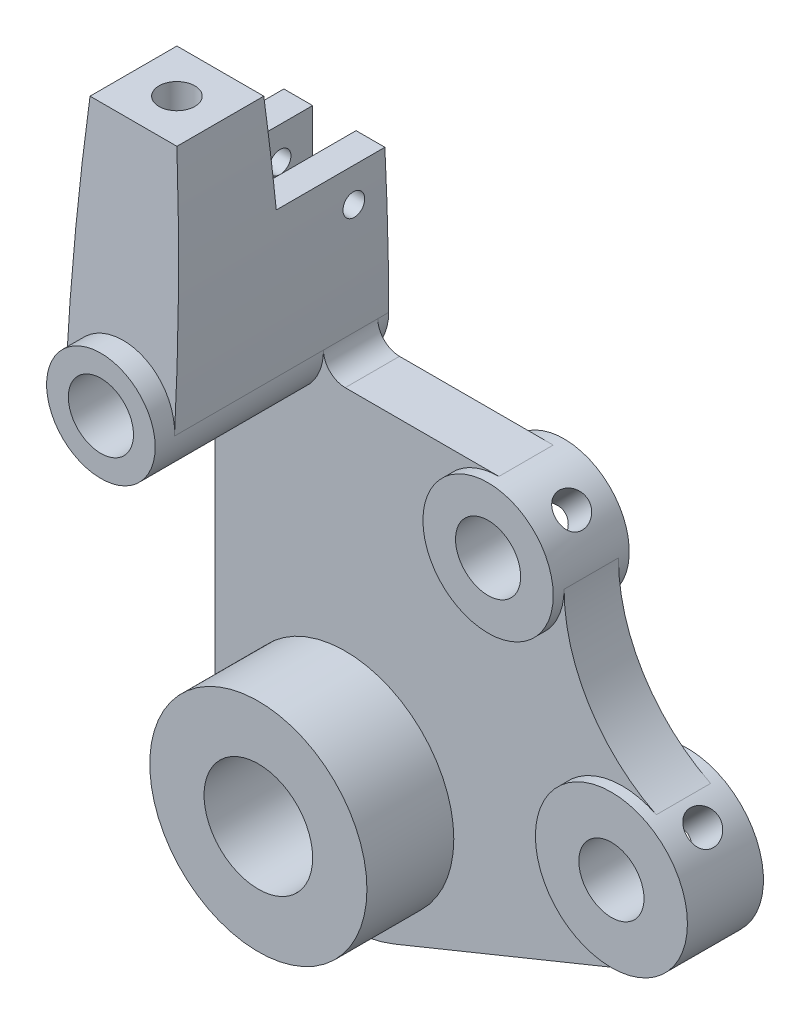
ISO-10303-21;
HEADER;
FILE_DESCRIPTION(('STEP AP214'),'2;1');
FILE_NAME('part.step','',(''),(''),'','','');
FILE_SCHEMA(('AUTOMOTIVE_DESIGN { 1 0 10303 214 1 1 1 1 }'));
ENDSEC;
DATA;
#1=APPLICATION_CONTEXT('core data for automotive mechanical design processes');
#2=APPLICATION_PROTOCOL_DEFINITION('international standard','automotive_design',2000,#1);
#3=PRODUCT_CONTEXT('',#1,'mechanical');
#4=PRODUCT('Part','Part','',(#3));
#5=PRODUCT_RELATED_PRODUCT_CATEGORY('part','',(#4));
#6=PRODUCT_DEFINITION_FORMATION('','',#4);
#7=PRODUCT_DEFINITION_CONTEXT('part definition',#1,'design');
#8=PRODUCT_DEFINITION('design','',#6,#7);
#9=PRODUCT_DEFINITION_SHAPE('','',#8);
#10=(LENGTH_UNIT() NAMED_UNIT(*) SI_UNIT(.MILLI.,.METRE.));
#11=(NAMED_UNIT(*) PLANE_ANGLE_UNIT() SI_UNIT($,.RADIAN.));
#12=(NAMED_UNIT(*) SI_UNIT($,.STERADIAN.) SOLID_ANGLE_UNIT());
#13=UNCERTAINTY_MEASURE_WITH_UNIT(LENGTH_MEASURE(1.E-05),#10,'distance_accuracy_value','');
#14=(GEOMETRIC_REPRESENTATION_CONTEXT(3) GLOBAL_UNCERTAINTY_ASSIGNED_CONTEXT((#13)) GLOBAL_UNIT_ASSIGNED_CONTEXT((#10,
#11,#12)) REPRESENTATION_CONTEXT('',''));
#15=CARTESIAN_POINT('',(0.,0.,0.));
#16=DIRECTION('',(0.,0.,1.));
#17=DIRECTION('',(1.,0.,0.));
#18=AXIS2_PLACEMENT_3D('',#15,#16,#17);
#19=CARTESIAN_POINT('',(-7.,33.,-1.));
#20=DIRECTION('',(0.,0.,1.));
#21=DIRECTION('',(1.,0.,0.));
#22=AXIS2_PLACEMENT_3D('',#19,#20,#21);
#23=CYLINDRICAL_SURFACE('',#22,2.);
#24=CARTESIAN_POINT('',(-7.,33.,9.));
#25=DIRECTION('',(0.,0.,1.));
#26=DIRECTION('',(1.,0.,0.));
#27=AXIS2_PLACEMENT_3D('',#24,#25,#26);
#28=CIRCLE('',#27,2.);
#29=CARTESIAN_POINT('',(-8.99999999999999,33.,9.));
#30=VERTEX_POINT('',#29);
#31=CARTESIAN_POINT('',(-4.99999999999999,33.,9.));
#32=VERTEX_POINT('',#31);
#33=EDGE_CURVE('E377',#30,#32,#28,.T.);
#34=ORIENTED_EDGE('',*,*,#33,.F.);
#35=EDGE_CURVE('E49',#32,#30,#28,.T.);
#36=ORIENTED_EDGE('',*,*,#35,.F.);
#37=EDGE_LOOP('',(#34,#36));
#38=FACE_BOUND('',#37,.T.);
#39=CARTESIAN_POINT('',(-7.,33.,10.5));
#40=DIRECTION('',(0.,0.,1.));
#41=DIRECTION('',(1.,0.,0.));
#42=AXIS2_PLACEMENT_3D('',#39,#40,#41);
#43=CIRCLE('',#42,2.);
#44=CARTESIAN_POINT('',(-5.,33.,10.5));
#45=VERTEX_POINT('',#44);
#46=EDGE_CURVE('E37',#45,#45,#43,.F.);
#47=ORIENTED_EDGE('',*,*,#46,.F.);
#48=EDGE_LOOP('',(#47));
#49=FACE_BOUND('',#48,.T.);
#50=ADVANCED_FACE('F33',(#38,#49),#23,.F.);
#51=CARTESIAN_POINT('',(-8.99999999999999,46.,9.));
#52=DIRECTION('',(0.,0.,1.));
#53=DIRECTION('',(1.,0.,0.));
#54=AXIS2_PLACEMENT_3D('',#51,#52,#53);
#55=PLANE('',#54);
#56=DIRECTION('',(0.,-1.,0.));
#57=VECTOR('',#56,1.);
#58=CARTESIAN_POINT('',(-4.99999999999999,46.,9.));
#59=LINE('',#58,#57);
#60=CARTESIAN_POINT('',(-4.99999999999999,46.,9.));
#61=VERTEX_POINT('',#60);
#62=EDGE_CURVE('E398',#61,#32,#59,.T.);
#63=ORIENTED_EDGE('',*,*,#62,.T.);
#64=ORIENTED_EDGE('',*,*,#35,.T.);
#65=DIRECTION('',(0.,-1.,0.));
#66=VECTOR('',#65,1.);
#67=CARTESIAN_POINT('',(-8.99999999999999,46.,9.));
#68=LINE('',#67,#66);
#69=CARTESIAN_POINT('',(-8.99999999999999,46.,9.));
#70=VERTEX_POINT('',#69);
#71=EDGE_CURVE('E386',#70,#30,#68,.T.);
#72=ORIENTED_EDGE('',*,*,#71,.F.);
#73=DIRECTION('',(1.,0.,0.));
#74=VECTOR('',#73,1.);
#75=CARTESIAN_POINT('',(-8.99999999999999,46.,9.));
#76=LINE('',#75,#74);
#77=EDGE_CURVE('E392',#70,#61,#76,.T.);
#78=ORIENTED_EDGE('',*,*,#77,.T.);
#79=EDGE_LOOP('',(#63,#64,#72,#78));
#80=FACE_BOUND('',#79,.T.);
#81=ADVANCED_FACE('F213',(#80),#55,.F.);
#82=CARTESIAN_POINT('',(-12.,46.,0.));
#83=DIRECTION('',(0.,-1.,0.));
#84=DIRECTION('',(0.,0.,-1.));
#85=AXIS2_PLACEMENT_3D('',#82,#83,#84);
#86=PLANE('',#85);
#87=DIRECTION('',(0.,0.,1.));
#88=VECTOR('',#87,1.);
#89=CARTESIAN_POINT('',(-4.99999999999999,46.,-1.));
#90=LINE('',#89,#88);
#91=CARTESIAN_POINT('',(-5.,46.,-1.));
#92=VERTEX_POINT('',#91);
#93=EDGE_CURVE('E394',#92,#61,#90,.T.);
#94=ORIENTED_EDGE('',*,*,#93,.T.);
#95=DIRECTION('',(1.,0.,0.));
#96=VECTOR('',#95,1.);
#97=CARTESIAN_POINT('',(-12.,46.,9.));
#98=LINE('',#97,#96);
#99=CARTESIAN_POINT('',(-2.34870431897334,46.,9.));
#100=VERTEX_POINT('',#99);
#101=EDGE_CURVE('E632',#61,#100,#98,.T.);
#102=ORIENTED_EDGE('',*,*,#101,.T.);
#103=DIRECTION('',(0.,0.,-1.));
#104=VECTOR('',#103,1.);
#105=CARTESIAN_POINT('',(-2.34870431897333,46.,5.));
#106=LINE('',#105,#104);
#107=CARTESIAN_POINT('',(-2.34870431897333,46.,-1.));
#108=VERTEX_POINT('',#107);
#109=EDGE_CURVE('E625',#108,#100,#106,.F.);
#110=ORIENTED_EDGE('',*,*,#109,.F.);
#111=DIRECTION('',(1.,0.,0.));
#112=VECTOR('',#111,1.);
#113=CARTESIAN_POINT('',(-11.6512956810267,46.,-1.));
#114=LINE('',#113,#112);
#115=EDGE_CURVE('E426',#92,#108,#114,.T.);
#116=ORIENTED_EDGE('',*,*,#115,.F.);
#117=EDGE_LOOP('',(#94,#102,#110,#116));
#118=FACE_BOUND('',#117,.T.);
#119=ADVANCED_FACE('F218',(#118),#86,.F.);
#120=CARTESIAN_POINT('',(0.,0.,0.));
#121=DIRECTION('',(0.,0.,1.));
#122=DIRECTION('',(1.,0.,0.));
#123=AXIS2_PLACEMENT_3D('',#120,#121,#122);
#124=PLANE('',#123);
#125=CARTESIAN_POINT('',(0.,0.,0.));
#126=DIRECTION('',(0.,0.,1.));
#127=DIRECTION('',(1.,0.,0.));
#128=AXIS2_PLACEMENT_3D('',#125,#126,#127);
#129=CIRCLE('',#128,10.);
#130=CARTESIAN_POINT('',(10.,0.,0.));
#131=VERTEX_POINT('',#130);
#132=EDGE_CURVE('E11',#131,#131,#129,.F.);
#133=ORIENTED_EDGE('',*,*,#132,.F.);
#134=EDGE_LOOP('',(#133));
#135=FACE_BOUND('',#134,.T.);
#136=CARTESIAN_POINT('',(25.5147016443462,5.,0.));
#137=DIRECTION('',(0.,0.,-1.));
#138=DIRECTION('',(-1.,0.,0.));
#139=AXIS2_PLACEMENT_3D('',#136,#137,#138);
#140=CIRCLE('',#139,7.00000000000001);
#141=CARTESIAN_POINT('',(28.1567565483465,-1.48224852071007,0.));
#142=VERTEX_POINT('',#141);
#143=CARTESIAN_POINT('',(28.6464939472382,11.2603416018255,0.));
#144=VERTEX_POINT('',#143);
#145=EDGE_CURVE('E405',#142,#144,#140,.T.);
#146=ORIENTED_EDGE('',*,*,#145,.F.);
#147=DIRECTION('',(0.92603550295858,0.377436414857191,0.));
#148=VECTOR('',#147,1.);
#149=CARTESIAN_POINT('',(4.5292369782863,-11.112426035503,0.));
#150=LINE('',#149,#148);
#151=CARTESIAN_POINT('',(4.5292369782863,-11.112426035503,0.));
#152=VERTEX_POINT('',#151);
#153=EDGE_CURVE('E546',#152,#142,#150,.T.);
#154=ORIENTED_EDGE('',*,*,#153,.F.);
#155=CARTESIAN_POINT('',(0.,0.,0.));
#156=DIRECTION('',(0.,0.,1.));
#157=DIRECTION('',(1.,0.,0.));
#158=AXIS2_PLACEMENT_3D('',#155,#156,#157);
#159=CIRCLE('',#158,12.);
#160=CARTESIAN_POINT('',(-12.,0.,0.));
#161=VERTEX_POINT('',#160);
#162=EDGE_CURVE('E543',#161,#152,#159,.T.);
#163=ORIENTED_EDGE('',*,*,#162,.F.);
#164=DIRECTION('',(0.,-1.,0.));
#165=VECTOR('',#164,1.);
#166=CARTESIAN_POINT('',(-12.,0.,0.));
#167=LINE('',#166,#165);
#168=CARTESIAN_POINT('',(-12.,33.,0.));
#169=VERTEX_POINT('',#168);
#170=EDGE_CURVE('E558',#169,#161,#167,.T.);
#171=ORIENTED_EDGE('',*,*,#170,.F.);
#172=CARTESIAN_POINT('',(-7.,33.,0.));
#173=DIRECTION('',(0.,0.,-1.));
#174=DIRECTION('',(-1.,0.,0.));
#175=AXIS2_PLACEMENT_3D('',#172,#173,#174);
#176=CIRCLE('',#175,5.00000000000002);
#177=CARTESIAN_POINT('',(-1.99999999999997,33.,0.));
#178=VERTEX_POINT('',#177);
#179=EDGE_CURVE('E421',#178,#169,#176,.T.);
#180=ORIENTED_EDGE('',*,*,#179,.F.);
#181=CARTESIAN_POINT('',(0.,33.,0.));
#182=DIRECTION('',(0.,0.,-1.));
#183=DIRECTION('',(-1.,0.,0.));
#184=AXIS2_PLACEMENT_3D('',#181,#182,#183);
#185=CIRCLE('',#184,1.99999999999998);
#186=CARTESIAN_POINT('',(0.,31.,0.));
#187=VERTEX_POINT('',#186);
#188=EDGE_CURVE('E555',#187,#178,#185,.T.);
#189=ORIENTED_EDGE('',*,*,#188,.F.);
#190=DIRECTION('',(-1.,0.,0.));
#191=VECTOR('',#190,1.);
#192=CARTESIAN_POINT('',(14.1568849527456,31.,0.));
#193=LINE('',#192,#191);
#194=CARTESIAN_POINT('',(14.1568849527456,31.,0.));
#195=VERTEX_POINT('',#194);
#196=EDGE_CURVE('E553',#195,#187,#193,.T.);
#197=ORIENTED_EDGE('',*,*,#196,.F.);
#198=CARTESIAN_POINT('',(14.1568849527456,25.,0.));
#199=DIRECTION('',(0.,0.,-1.));
#200=DIRECTION('',(-1.,0.,0.));
#201=AXIS2_PLACEMENT_3D('',#198,#199,#200);
#202=CIRCLE('',#201,6.);
#203=CARTESIAN_POINT('',(20.1568849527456,25.,0.));
#204=VERTEX_POINT('',#203);
#205=EDGE_CURVE('E417',#204,#195,#202,.T.);
#206=ORIENTED_EDGE('',*,*,#205,.F.);
#207=CARTESIAN_POINT('',(35.5198818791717,25.,0.));
#208=DIRECTION('',(0.,0.,-1.));
#209=DIRECTION('',(1.,0.,0.));
#210=AXIS2_PLACEMENT_3D('',#207,#208,#209);
#211=CIRCLE('',#210,15.3629969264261);
#212=EDGE_CURVE('E550',#144,#204,#211,.T.);
#213=ORIENTED_EDGE('',*,*,#212,.F.);
#214=EDGE_LOOP('',(#146,#154,#163,#171,#180,#189,#197,#206,#213));
#215=FACE_BOUND('',#214,.T.);
#216=ADVANCED_FACE('F273',(#135,#215),#124,.F.);
#217=CARTESIAN_POINT('',(-12.,55.,17.5));
#218=DIRECTION('',(0.,-0.0554700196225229,-0.998460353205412));
#219=DIRECTION('',(0.,0.998460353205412,-0.0554700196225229));
#220=AXIS2_PLACEMENT_3D('',#217,#218,#219);
#221=PLANE('',#220);
#222=CARTESIAN_POINT('',(-7.,33.,18.7222222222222));
#223=DIRECTION('',(0.,-0.0554700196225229,-0.998460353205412));
#224=DIRECTION('',(0.,-0.998460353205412,0.0554700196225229));
#225=AXIS2_PLACEMENT_3D('',#222,#223,#224);
#226=ELLIPSE('',#225,5.00771010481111,5.00000000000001);
#227=CARTESIAN_POINT('',(-1.99999999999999,33.,18.7222222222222));
#228=VERTEX_POINT('',#227);
#229=CARTESIAN_POINT('',(-12.,33.,18.7222222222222));
#230=VERTEX_POINT('',#229);
#231=EDGE_CURVE('E445',#228,#230,#226,.F.);
#232=ORIENTED_EDGE('',*,*,#231,.F.);
#233=CARTESIAN_POINT('',(-244.499999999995,33.,18.7222222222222));
#234=DIRECTION('',(0.,-0.0554700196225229,-0.998460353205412));
#235=DIRECTION('',(0.,0.998460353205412,-0.0554700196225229));
#236=AXIS2_PLACEMENT_3D('',#233,#234,#235);
#237=ELLIPSE('',#236,242.873940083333,242.499999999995);
#238=CARTESIAN_POINT('',(-3.,55.,17.5));
#239=VERTEX_POINT('',#238);
#240=EDGE_CURVE('E457',#239,#228,#237,.T.);
#241=ORIENTED_EDGE('',*,*,#240,.F.);
#242=DIRECTION('',(1.,0.,0.));
#243=VECTOR('',#242,1.);
#244=CARTESIAN_POINT('',(-12.,55.,17.5));
#245=LINE('',#244,#243);
#246=CARTESIAN_POINT('',(-11.,55.,17.5));
#247=VERTEX_POINT('',#246);
#248=EDGE_CURVE('E448',#247,#239,#245,.T.);
#249=ORIENTED_EDGE('',*,*,#248,.F.);
#250=CARTESIAN_POINT('',(230.499999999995,33.,18.7222222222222));
#251=DIRECTION('',(0.,-0.0554700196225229,-0.998460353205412));
#252=DIRECTION('',(0.,0.998460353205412,-0.0554700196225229));
#253=AXIS2_PLACEMENT_3D('',#250,#251,#252);
#254=ELLIPSE('',#253,242.873940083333,242.499999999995);
#255=EDGE_CURVE('E454',#230,#247,#254,.T.);
#256=ORIENTED_EDGE('',*,*,#255,.F.);
#257=EDGE_LOOP('',(#232,#241,#249,#256));
#258=FACE_BOUND('',#257,.T.);
#259=ADVANCED_FACE('F269',(#258),#221,.F.);
#260=CARTESIAN_POINT('',(0.,0.,5.));
#261=DIRECTION('',(0.,0.,1.));
#262=DIRECTION('',(1.,0.,0.));
#263=AXIS2_PLACEMENT_3D('',#260,#261,#262);
#264=PLANE('',#263);
#265=CARTESIAN_POINT('',(0.,0.,5.));
#266=DIRECTION('',(0.,0.,1.));
#267=DIRECTION('',(1.,0.,0.));
#268=AXIS2_PLACEMENT_3D('',#265,#266,#267);
#269=CIRCLE('',#268,10.);
#270=CARTESIAN_POINT('',(10.,0.,5.));
#271=VERTEX_POINT('',#270);
#272=EDGE_CURVE('E462',#271,#271,#269,.T.);
#273=ORIENTED_EDGE('',*,*,#272,.F.);
#274=EDGE_LOOP('',(#273));
#275=FACE_BOUND('',#274,.T.);
#276=CARTESIAN_POINT('',(0.,33.,5.));
#277=DIRECTION('',(0.,0.,-1.));
#278=DIRECTION('',(-1.,0.,0.));
#279=AXIS2_PLACEMENT_3D('',#276,#277,#278);
#280=CIRCLE('',#279,1.99999999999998);
#281=CARTESIAN_POINT('',(0.,31.,5.));
#282=VERTEX_POINT('',#281);
#283=CARTESIAN_POINT('',(-1.99999999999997,33.,5.));
#284=VERTEX_POINT('',#283);
#285=EDGE_CURVE('E535',#282,#284,#280,.T.);
#286=ORIENTED_EDGE('',*,*,#285,.T.);
#287=CARTESIAN_POINT('',(-7.,33.,5.));
#288=DIRECTION('',(0.,0.,1.));
#289=DIRECTION('',(1.,0.,0.));
#290=AXIS2_PLACEMENT_3D('',#287,#288,#289);
#291=CIRCLE('',#290,5.00000000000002);
#292=CARTESIAN_POINT('',(-12.,33.,5.));
#293=VERTEX_POINT('',#292);
#294=EDGE_CURVE('E472',#293,#284,#291,.T.);
#295=ORIENTED_EDGE('',*,*,#294,.F.);
#296=DIRECTION('',(0.,-1.,0.));
#297=VECTOR('',#296,1.);
#298=CARTESIAN_POINT('',(-12.,0.,5.));
#299=LINE('',#298,#297);
#300=CARTESIAN_POINT('',(-12.,0.,5.));
#301=VERTEX_POINT('',#300);
#302=EDGE_CURVE('E529',#293,#301,#299,.T.);
#303=ORIENTED_EDGE('',*,*,#302,.T.);
#304=CARTESIAN_POINT('',(0.,0.,5.));
#305=DIRECTION('',(0.,0.,1.));
#306=DIRECTION('',(1.,0.,0.));
#307=AXIS2_PLACEMENT_3D('',#304,#305,#306);
#308=CIRCLE('',#307,12.);
#309=CARTESIAN_POINT('',(4.5292369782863,-11.112426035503,5.));
#310=VERTEX_POINT('',#309);
#311=EDGE_CURVE('E559',#301,#310,#308,.T.);
#312=ORIENTED_EDGE('',*,*,#311,.T.);
#313=DIRECTION('',(0.92603550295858,0.377436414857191,0.));
#314=VECTOR('',#313,1.);
#315=CARTESIAN_POINT('',(4.5292369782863,-11.112426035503,5.));
#316=LINE('',#315,#314);
#317=CARTESIAN_POINT('',(28.1567565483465,-1.48224852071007,5.));
#318=VERTEX_POINT('',#317);
#319=EDGE_CURVE('E602',#310,#318,#316,.T.);
#320=ORIENTED_EDGE('',*,*,#319,.T.);
#321=CARTESIAN_POINT('',(25.5147016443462,5.,5.));
#322=DIRECTION('',(0.,0.,1.));
#323=DIRECTION('',(1.,0.,0.));
#324=AXIS2_PLACEMENT_3D('',#321,#322,#323);
#325=CIRCLE('',#324,7.00000000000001);
#326=CARTESIAN_POINT('',(28.6464939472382,11.2603416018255,5.));
#327=VERTEX_POINT('',#326);
#328=EDGE_CURVE('E611',#327,#318,#325,.T.);
#329=ORIENTED_EDGE('',*,*,#328,.F.);
#330=CARTESIAN_POINT('',(35.5198818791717,25.,5.));
#331=DIRECTION('',(0.,0.,-1.));
#332=DIRECTION('',(1.,0.,0.));
#333=AXIS2_PLACEMENT_3D('',#330,#331,#332);
#334=CIRCLE('',#333,15.3629969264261);
#335=CARTESIAN_POINT('',(20.1568849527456,25.,5.));
#336=VERTEX_POINT('',#335);
#337=EDGE_CURVE('E597',#327,#336,#334,.T.);
#338=ORIENTED_EDGE('',*,*,#337,.T.);
#339=CARTESIAN_POINT('',(14.1568849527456,25.,5.));
#340=DIRECTION('',(0.,0.,1.));
#341=DIRECTION('',(1.,0.,0.));
#342=AXIS2_PLACEMENT_3D('',#339,#340,#341);
#343=CIRCLE('',#342,6.);
#344=CARTESIAN_POINT('',(14.1568849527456,31.,5.));
#345=VERTEX_POINT('',#344);
#346=EDGE_CURVE('E583',#345,#336,#343,.T.);
#347=ORIENTED_EDGE('',*,*,#346,.F.);
#348=DIRECTION('',(-1.,0.,0.));
#349=VECTOR('',#348,1.);
#350=CARTESIAN_POINT('',(14.1568849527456,31.,5.));
#351=LINE('',#350,#349);
#352=EDGE_CURVE('E539',#345,#282,#351,.T.);
#353=ORIENTED_EDGE('',*,*,#352,.T.);
#354=EDGE_LOOP('',(#286,#295,#303,#312,#320,#329,#338,#347,#353));
#355=FACE_BOUND('',#354,.T.);
#356=ADVANCED_FACE('F272',(#275,#355),#264,.T.);
#357=CARTESIAN_POINT('',(0.,0.,5.));
#358=DIRECTION('',(0.,0.,-1.));
#359=DIRECTION('',(-1.,0.,0.));
#360=AXIS2_PLACEMENT_3D('',#357,#358,#359);
#361=CYLINDRICAL_SURFACE('',#360,12.);
#362=ORIENTED_EDGE('',*,*,#162,.T.);
#363=DIRECTION('',(0.,0.,-1.));
#364=VECTOR('',#363,1.);
#365=CARTESIAN_POINT('',(4.5292369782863,-11.112426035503,5.));
#366=LINE('',#365,#364);
#367=EDGE_CURVE('E580',#310,#152,#366,.T.);
#368=ORIENTED_EDGE('',*,*,#367,.F.);
#369=ORIENTED_EDGE('',*,*,#311,.F.);
#370=DIRECTION('',(0.,0.,-1.));
#371=VECTOR('',#370,1.);
#372=CARTESIAN_POINT('',(-12.,0.,5.));
#373=LINE('',#372,#371);
#374=EDGE_CURVE('E531',#301,#161,#373,.T.);
#375=ORIENTED_EDGE('',*,*,#374,.T.);
#376=EDGE_LOOP('',(#362,#368,#369,#375));
#377=FACE_BOUND('',#376,.T.);
#378=ADVANCED_FACE('F35',(#377),#361,.T.);
#379=CARTESIAN_POINT('',(4.5292369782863,-11.112426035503,5.));
#380=DIRECTION('',(-0.377436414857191,0.92603550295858,0.));
#381=DIRECTION('',(-0.92603550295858,-0.377436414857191,0.));
#382=AXIS2_PLACEMENT_3D('',#379,#380,#381);
#383=PLANE('',#382);
#384=ORIENTED_EDGE('',*,*,#153,.T.);
#385=DIRECTION('',(0.,0.,-1.));
#386=VECTOR('',#385,1.);
#387=CARTESIAN_POINT('',(28.1567565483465,-1.48224852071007,5.));
#388=LINE('',#387,#386);
#389=EDGE_CURVE('E576',#318,#142,#388,.T.);
#390=ORIENTED_EDGE('',*,*,#389,.F.);
#391=ORIENTED_EDGE('',*,*,#319,.F.);
#392=ORIENTED_EDGE('',*,*,#367,.T.);
#393=EDGE_LOOP('',(#384,#390,#391,#392));
#394=FACE_BOUND('',#393,.T.);
#395=ADVANCED_FACE('F676',(#394),#383,.F.);
#396=CARTESIAN_POINT('',(25.5147016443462,5.,5.));
#397=DIRECTION('',(0.,0.,-1.));
#398=DIRECTION('',(-1.,0.,0.));
#399=AXIS2_PLACEMENT_3D('',#396,#397,#398);
#400=CYLINDRICAL_SURFACE('',#399,7.00000000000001);
#401=CARTESIAN_POINT('',(29.2888113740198,10.8954300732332,2.5));
#402=CARTESIAN_POINT('',(29.2888146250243,10.8954291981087,2.58321115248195));
#403=CARTESIAN_POINT('',(29.2948098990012,10.8916031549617,2.66645777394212));
#404=CARTESIAN_POINT('',(29.3185162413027,10.8763241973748,2.830586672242));
#405=CARTESIAN_POINT('',(29.3362360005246,10.8648656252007,2.91146714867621));
#406=CARTESIAN_POINT('',(29.3825421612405,10.8344298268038,3.0684657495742));
#407=CARTESIAN_POINT('',(29.4111169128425,10.815460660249,3.14458887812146));
#408=CARTESIAN_POINT('',(29.4778870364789,10.7701630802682,3.29011527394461));
#409=CARTESIAN_POINT('',(29.5160821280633,10.7438348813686,3.35951873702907));
#410=CARTESIAN_POINT('',(29.6011738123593,10.6836162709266,3.49076296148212));
#411=CARTESIAN_POINT('',(29.6481890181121,10.6496213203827,3.55247887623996));
#412=CARTESIAN_POINT('',(29.7487350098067,10.5746647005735,3.66550355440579));
#413=CARTESIAN_POINT('',(29.8022662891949,10.5337025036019,3.71681152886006));
#414=CARTESIAN_POINT('',(29.9144617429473,10.4449307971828,3.80805544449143));
#415=CARTESIAN_POINT('',(29.9731721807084,10.3970564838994,3.84787165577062));
#416=CARTESIAN_POINT('',(30.0931561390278,10.29565065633,3.91422769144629));
#417=CARTESIAN_POINT('',(30.1544293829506,10.2421197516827,3.94076894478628));
#418=CARTESIAN_POINT('',(30.2765061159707,10.1314617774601,3.97942997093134));
#419=CARTESIAN_POINT('',(30.3373027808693,10.0744010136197,3.99176092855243));
#420=CARTESIAN_POINT('',(30.4574096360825,9.95748503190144,4.00231127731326));
#421=CARTESIAN_POINT('',(30.516719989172,9.89763012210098,4.00053222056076));
#422=CARTESIAN_POINT('',(30.6311877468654,9.77789929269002,3.98307103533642));
#423=CARTESIAN_POINT('',(30.6863971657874,9.71803968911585,3.96761649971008));
#424=CARTESIAN_POINT('',(30.7923591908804,9.59920349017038,3.92360531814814));
#425=CARTESIAN_POINT('',(30.8431116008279,9.54022693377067,3.89504809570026));
#426=CARTESIAN_POINT('',(30.9394587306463,9.42467122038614,3.82543854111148));
#427=CARTESIAN_POINT('',(30.9850144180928,9.36811197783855,3.78429923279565));
#428=CARTESIAN_POINT('',(31.0698024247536,9.25976469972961,3.69075803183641));
#429=CARTESIAN_POINT('',(31.1090339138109,9.20797729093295,3.6383546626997));
#430=CARTESIAN_POINT('',(31.1813813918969,9.11005192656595,3.52253145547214));
#431=CARTESIAN_POINT('',(31.2143595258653,9.0640475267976,3.45891242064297));
#432=CARTESIAN_POINT('',(31.2728546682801,8.98073769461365,3.32311671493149));
#433=CARTESIAN_POINT('',(31.2983714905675,8.94343247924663,3.25093983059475));
#434=CARTESIAN_POINT('',(31.3417713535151,8.87901771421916,3.09977549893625));
#435=CARTESIAN_POINT('',(31.359633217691,8.8519364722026,3.02076987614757));
#436=CARTESIAN_POINT('',(31.3874627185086,8.80937405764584,2.85836723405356));
#437=CARTESIAN_POINT('',(31.3974315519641,8.79389112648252,2.77497088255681));
#438=CARTESIAN_POINT('',(31.4092743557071,8.77546439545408,2.60790424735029));
#439=CARTESIAN_POINT('',(31.4113030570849,8.77228092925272,2.5242713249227));
#440=CARTESIAN_POINT('',(31.407675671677,8.77794495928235,2.35758600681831));
#441=CARTESIAN_POINT('',(31.4020200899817,8.78679166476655,2.27453357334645));
#442=CARTESIAN_POINT('',(31.3831810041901,8.81591956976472,2.11232956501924));
#443=CARTESIAN_POINT('',(31.3700830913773,8.83607072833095,2.03314456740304));
#444=CARTESIAN_POINT('',(31.3365303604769,8.88680197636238,1.87983766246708));
#445=CARTESIAN_POINT('',(31.3160748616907,8.9173830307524,1.80571622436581));
#446=CARTESIAN_POINT('',(31.2676173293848,8.98821044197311,1.66343031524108));
#447=CARTESIAN_POINT('',(31.2395079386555,9.02859333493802,1.59537041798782));
#448=CARTESIAN_POINT('',(31.1761447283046,9.11716170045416,1.46824165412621));
#449=CARTESIAN_POINT('',(31.1408900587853,9.16534810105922,1.40917385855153));
#450=CARTESIAN_POINT('',(31.062940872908,9.26864074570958,1.30062969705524));
#451=CARTESIAN_POINT('',(31.0201249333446,9.32385503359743,1.25134308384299));
#452=CARTESIAN_POINT('',(30.9281397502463,9.43847718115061,1.16511459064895));
#453=CARTESIAN_POINT('',(30.878970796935,9.49788484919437,1.12817214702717));
#454=CARTESIAN_POINT('',(30.775546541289,9.61841658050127,1.06794794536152));
#455=CARTESIAN_POINT('',(30.7213251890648,9.67952749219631,1.04458169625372));
#456=CARTESIAN_POINT('',(30.6088152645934,9.80176007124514,1.01190829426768));
#457=CARTESIAN_POINT('',(30.5505272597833,9.86288173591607,1.00259918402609));
#458=CARTESIAN_POINT('',(30.4326868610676,9.98199777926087,0.998389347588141));
#459=CARTESIAN_POINT('',(30.3731829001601,10.0400302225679,1.00320484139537));
#460=CARTESIAN_POINT('',(30.2535846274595,10.1526436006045,1.02647476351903));
#461=CARTESIAN_POINT('',(30.193490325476,10.2072245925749,1.04492896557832));
#462=CARTESIAN_POINT('',(30.0747992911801,10.3114720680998,1.09481880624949));
#463=CARTESIAN_POINT('',(30.0161986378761,10.361152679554,1.12621568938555));
#464=CARTESIAN_POINT('',(29.9022323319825,10.4548163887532,1.20106127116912));
#465=CARTESIAN_POINT('',(29.8468669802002,10.4987989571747,1.24451108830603));
#466=CARTESIAN_POINT('',(29.7402910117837,10.5811304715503,1.34316231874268));
#467=CARTESIAN_POINT('',(29.6891749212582,10.6193616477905,1.39856415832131));
#468=CARTESIAN_POINT('',(29.5941328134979,10.6887355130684,1.51914061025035));
#469=CARTESIAN_POINT('',(29.5502085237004,10.719876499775,1.58431756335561));
#470=CARTESIAN_POINT('',(29.4707903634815,10.7750963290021,1.72359049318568));
#471=CARTESIAN_POINT('',(29.4354108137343,10.7990803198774,1.79778935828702));
#472=CARTESIAN_POINT('',(29.3753879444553,10.8392135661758,1.95234372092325));
#473=CARTESIAN_POINT('',(29.3507353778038,10.8553695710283,2.03269384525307));
#474=CARTESIAN_POINT('',(29.3177478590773,10.8768292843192,2.17762613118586));
#475=CARTESIAN_POINT('',(29.3069261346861,10.8838004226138,2.24141167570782));
#476=CARTESIAN_POINT('',(29.2924567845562,10.8931010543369,2.37012431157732));
#477=CARTESIAN_POINT('',(29.2888088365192,10.8954307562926,2.43505135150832));
#478=CARTESIAN_POINT('',(29.2888113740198,10.8954300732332,2.5));
#479=B_SPLINE_CURVE_WITH_KNOTS('',3,(#401,#402,#403,#404,#405,#406,#407,#408,#409,#410,#411,
#412,#413,#414,#415,#416,#417,#418,#419,#420,#421,#422,#423,#424,#425,#426,#427,#428,#429,#430,
#431,#432,#433,#434,#435,#436,#437,#438,#439,#440,#441,#442,#443,#444,#445,#446,#447,#448,#449,
#450,#451,#452,#453,#454,#455,#456,#457,#458,#459,#460,#461,#462,#463,#464,#465,#466,#467,#468,
#469,#470,#471,#472,#473,#474,#475,#476,#477,#478),.UNSPECIFIED.,.T.,.F.,(4,2,2,2,2,2,2,2,2,2,2,
2,2,2,2,2,2,2,2,2,2,2,2,2,2,2,2,2,2,2,2,2,2,2,2,2,2,2,4),(0.,0.249395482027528,
0.498976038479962,0.748289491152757,0.997595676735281,1.25053229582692,1.50348808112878,
1.75899134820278,2.01446710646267,2.26609508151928,2.5176953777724,2.76518557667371,
3.01268666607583,3.26193888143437,3.51122378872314,3.76548960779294,4.01976177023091,
4.2747328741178,4.52966530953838,4.77960433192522,5.02952692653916,5.27663180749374,
5.5237595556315,5.77455010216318,6.02537049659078,6.2806621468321,6.53594213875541,
6.78961589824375,7.04325433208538,7.29183199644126,7.54040553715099,7.78824009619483,
8.03609766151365,8.28848914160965,8.54094115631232,8.79660380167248,9.05204561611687,
9.24671456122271,9.44137476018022),.UNSPECIFIED.);
#480=CARTESIAN_POINT('',(29.2888113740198,10.8954300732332,2.5));
#481=VERTEX_POINT('',#480);
#482=EDGE_CURVE('E194',#481,#481,#479,.T.);
#483=ORIENTED_EDGE('',*,*,#482,.F.);
#484=EDGE_LOOP('',(#483));
#485=FACE_BOUND('',#484,.T.);
#486=ORIENTED_EDGE('',*,*,#389,.T.);
#487=ORIENTED_EDGE('',*,*,#145,.T.);
#488=DIRECTION('',(0.,0.,-1.));
#489=VECTOR('',#488,1.);
#490=CARTESIAN_POINT('',(28.6464939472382,11.2603416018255,5.));
#491=LINE('',#490,#489);
#492=EDGE_CURVE('E573',#327,#144,#491,.T.);
#493=ORIENTED_EDGE('',*,*,#492,.F.);
#494=ORIENTED_EDGE('',*,*,#328,.T.);
#495=EDGE_LOOP('',(#486,#487,#493,#494));
#496=FACE_BOUND('',#495,.T.);
#497=CARTESIAN_POINT('',(25.5147016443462,5.,6.));
#498=DIRECTION('',(0.,0.,1.));
#499=DIRECTION('',(1.,0.,0.));
#500=AXIS2_PLACEMENT_3D('',#497,#498,#499);
#501=CIRCLE('',#500,7.00000000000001);
#502=CARTESIAN_POINT('',(32.5147016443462,5.,6.));
#503=VERTEX_POINT('',#502);
#504=EDGE_CURVE('E610',#503,#503,#501,.T.);
#505=ORIENTED_EDGE('',*,*,#504,.F.);
#506=EDGE_LOOP('',(#505));
#507=FACE_BOUND('',#506,.T.);
#508=CARTESIAN_POINT('',(25.5147016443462,5.,-1.));
#509=DIRECTION('',(0.,0.,-1.));
#510=DIRECTION('',(-1.,0.,0.));
#511=AXIS2_PLACEMENT_3D('',#508,#509,#510);
#512=CIRCLE('',#511,7.00000000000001);
#513=CARTESIAN_POINT('',(18.5147016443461,5.,-1.));
#514=VERTEX_POINT('',#513);
#515=EDGE_CURVE('E410',#514,#514,#512,.T.);
#516=ORIENTED_EDGE('',*,*,#515,.F.);
#517=EDGE_LOOP('',(#516));
#518=FACE_BOUND('',#517,.T.);
#519=ADVANCED_FACE('F679',(#485,#496,#507,#518),#400,.T.);
#520=CARTESIAN_POINT('',(35.5198818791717,25.,5.));
#521=DIRECTION('',(0.,0.,-1.));
#522=DIRECTION('',(-1.,0.,0.));
#523=AXIS2_PLACEMENT_3D('',#520,#521,#522);
#524=CYLINDRICAL_SURFACE('',#523,15.3629969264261);
#525=ORIENTED_EDGE('',*,*,#212,.T.);
#526=DIRECTION('',(0.,0.,-1.));
#527=VECTOR('',#526,1.);
#528=CARTESIAN_POINT('',(20.1568849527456,25.,5.));
#529=LINE('',#528,#527);
#530=EDGE_CURVE('E577',#336,#204,#529,.T.);
#531=ORIENTED_EDGE('',*,*,#530,.F.);
#532=ORIENTED_EDGE('',*,*,#337,.F.);
#533=ORIENTED_EDGE('',*,*,#492,.T.);
#534=EDGE_LOOP('',(#525,#531,#532,#533));
#535=FACE_BOUND('',#534,.T.);
#536=ADVANCED_FACE('F683',(#535),#524,.F.);
#537=CARTESIAN_POINT('',(14.1568849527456,25.,5.));
#538=DIRECTION('',(0.,0.,-1.));
#539=DIRECTION('',(-1.,0.,0.));
#540=AXIS2_PLACEMENT_3D('',#537,#538,#539);
#541=CYLINDRICAL_SURFACE('',#540,6.);
#542=CARTESIAN_POINT('',(17.2041439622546,30.1685793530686,2.5));
#543=CARTESIAN_POINT('',(17.2041467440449,30.1685788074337,2.58283045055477));
#544=CARTESIAN_POINT('',(17.2102781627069,30.1649777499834,2.6656869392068));
#545=CARTESIAN_POINT('',(17.2344945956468,30.1505835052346,2.82902054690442));
#546=CARTESIAN_POINT('',(17.2525865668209,30.1397861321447,2.90949625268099));
#547=CARTESIAN_POINT('',(17.2997890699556,30.1110576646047,3.06568212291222));
#548=CARTESIAN_POINT('',(17.3288853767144,30.0931357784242,3.1413982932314));
#549=CARTESIAN_POINT('',(17.3967608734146,30.0502286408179,3.28618651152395));
#550=CARTESIAN_POINT('',(17.4355404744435,30.0252430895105,3.35525827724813));
#551=CARTESIAN_POINT('',(17.5220197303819,29.9677570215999,3.48631698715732));
#552=CARTESIAN_POINT('',(17.5698811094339,29.9351172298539,3.54813616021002));
#553=CARTESIAN_POINT('',(17.6721022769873,29.8628344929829,3.6614568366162));
#554=CARTESIAN_POINT('',(17.7264626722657,29.8231908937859,3.71295737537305));
#555=CARTESIAN_POINT('',(17.8404554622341,29.7367171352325,3.80486528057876));
#556=CARTESIAN_POINT('',(17.9001508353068,29.6897944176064,3.84510783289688));
#557=CARTESIAN_POINT('',(18.0219496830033,29.5899310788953,3.91228578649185));
#558=CARTESIAN_POINT('',(18.0840528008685,29.5369913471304,3.93922315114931));
#559=CARTESIAN_POINT('',(18.2072019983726,29.4273679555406,3.97848870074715));
#560=CARTESIAN_POINT('',(18.268244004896,29.3707818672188,3.99110178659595));
#561=CARTESIAN_POINT('',(18.3885402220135,29.2544202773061,4.00225502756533));
#562=CARTESIAN_POINT('',(18.447794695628,29.19464524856,4.00079726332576));
#563=CARTESIAN_POINT('',(18.561493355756,29.0750565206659,3.98405508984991));
#564=CARTESIAN_POINT('',(18.6160151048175,29.0152731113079,3.96907820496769));
#565=CARTESIAN_POINT('',(18.7203770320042,28.8962556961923,3.9262172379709));
#566=CARTESIAN_POINT('',(18.7702169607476,28.8370217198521,3.89833246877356));
#567=CARTESIAN_POINT('',(18.8646853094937,28.7205236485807,3.83019845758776));
#568=CARTESIAN_POINT('',(18.9092625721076,28.663282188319,3.78983977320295));
#569=CARTESIAN_POINT('',(18.9920477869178,28.5533006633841,3.69798659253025));
#570=CARTESIAN_POINT('',(19.030254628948,28.5005613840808,3.64649015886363));
#571=CARTESIAN_POINT('',(19.100864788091,28.4001379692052,3.53217475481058));
#572=CARTESIAN_POINT('',(19.133083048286,28.3526292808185,3.46908706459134));
#573=CARTESIAN_POINT('',(19.1901804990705,28.2662858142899,3.33424001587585));
#574=CARTESIAN_POINT('',(19.2150593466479,28.2274514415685,3.2624802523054));
#575=CARTESIAN_POINT('',(19.2574619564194,28.1600183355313,3.11182597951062));
#576=CARTESIAN_POINT('',(19.2749494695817,28.1314701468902,3.03289856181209));
#577=CARTESIAN_POINT('',(19.3023173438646,28.0862972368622,2.87044871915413));
#578=CARTESIAN_POINT('',(19.3121993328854,28.0696699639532,2.78692728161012));
#579=CARTESIAN_POINT('',(19.3241596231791,28.0494929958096,2.62002429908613));
#580=CARTESIAN_POINT('',(19.3264371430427,28.0456094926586,2.53669732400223));
#581=CARTESIAN_POINT('',(19.3237384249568,28.0501856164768,2.37050683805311));
#582=CARTESIAN_POINT('',(19.3187628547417,28.0586441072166,2.28764328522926));
#583=CARTESIAN_POINT('',(19.3017216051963,28.087219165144,2.12613144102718));
#584=CARTESIAN_POINT('',(19.2897732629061,28.1071427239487,2.0474363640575));
#585=CARTESIAN_POINT('',(19.2589256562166,28.1575382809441,1.894941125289));
#586=CARTESIAN_POINT('',(19.240025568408,28.1880115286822,1.8211415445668));
#587=CARTESIAN_POINT('',(19.1949070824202,28.2588532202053,1.6789352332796));
#588=CARTESIAN_POINT('',(19.1685523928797,28.2994040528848,1.61066269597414));
#589=CARTESIAN_POINT('',(19.1088194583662,28.3883935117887,1.48288698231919));
#590=CARTESIAN_POINT('',(19.0754400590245,28.4368334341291,1.42338525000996));
#591=CARTESIAN_POINT('',(19.0009754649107,28.5410425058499,1.31331337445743));
#592=CARTESIAN_POINT('',(18.959718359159,28.5969647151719,1.26300396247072));
#593=CARTESIAN_POINT('',(18.8705558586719,28.7130384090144,1.17463847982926));
#594=CARTESIAN_POINT('',(18.8226508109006,28.7731896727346,1.13658177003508));
#595=CARTESIAN_POINT('',(18.7213709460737,28.8950859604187,1.07413237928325));
#596=CARTESIAN_POINT('',(18.6680388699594,28.9568160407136,1.04964142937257));
#597=CARTESIAN_POINT('',(18.5568119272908,29.0801384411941,1.01472379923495));
#598=CARTESIAN_POINT('',(18.4989179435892,29.1417307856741,1.00429440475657));
#599=CARTESIAN_POINT('',(18.3817682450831,29.2611229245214,0.997948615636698));
#600=CARTESIAN_POINT('',(18.3225916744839,29.3189802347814,1.00164743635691));
#601=CARTESIAN_POINT('',(18.2031883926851,29.4310419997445,1.0225717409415));
#602=CARTESIAN_POINT('',(18.1429617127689,29.4852465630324,1.03979682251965));
#603=CARTESIAN_POINT('',(18.0237160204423,29.5884428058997,1.08707832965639));
#604=CARTESIAN_POINT('',(17.9646922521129,29.6374609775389,1.11706517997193));
#605=CARTESIAN_POINT('',(17.8494628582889,29.7297275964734,1.18895586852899));
#606=CARTESIAN_POINT('',(17.7932575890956,29.7729753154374,1.23086120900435));
#607=CARTESIAN_POINT('',(17.6842912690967,29.8540841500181,1.32657285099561));
#608=CARTESIAN_POINT('',(17.6316449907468,29.8917913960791,1.38064021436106));
#609=CARTESIAN_POINT('',(17.5332754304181,29.960200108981,1.4986342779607));
#610=CARTESIAN_POINT('',(17.4875539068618,29.9908997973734,1.56256347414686));
#611=CARTESIAN_POINT('',(17.4041095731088,30.0455994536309,1.699902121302));
#612=CARTESIAN_POINT('',(17.3665518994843,30.0694637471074,1.77346618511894));
#613=CARTESIAN_POINT('',(17.3022861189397,30.1095887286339,1.92708323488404));
#614=CARTESIAN_POINT('',(17.2755701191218,30.1258549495,2.0071314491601));
#615=CARTESIAN_POINT('',(17.2382051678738,30.1483825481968,2.15586551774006));
#616=CARTESIAN_POINT('',(17.2254739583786,30.1559537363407,2.22383974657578));
#617=CARTESIAN_POINT('',(17.2084425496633,30.1660521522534,2.36120330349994));
#618=CARTESIAN_POINT('',(17.2041416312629,30.1685798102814,2.43059251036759));
#619=CARTESIAN_POINT('',(17.2041439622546,30.1685793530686,2.5));
#620=B_SPLINE_CURVE_WITH_KNOTS('',3,(#542,#543,#544,#545,#546,#547,#548,#549,#550,#551,#552,
#553,#554,#555,#556,#557,#558,#559,#560,#561,#562,#563,#564,#565,#566,#567,#568,#569,#570,#571,
#572,#573,#574,#575,#576,#577,#578,#579,#580,#581,#582,#583,#584,#585,#586,#587,#588,#589,#590,
#591,#592,#593,#594,#595,#596,#597,#598,#599,#600,#601,#602,#603,#604,#605,#606,#607,#608,#609,
#610,#611,#612,#613,#614,#615,#616,#617,#618,#619),.UNSPECIFIED.,.T.,.F.,(4,2,2,2,2,2,2,2,2,2,2,
2,2,2,2,2,2,2,2,2,2,2,2,2,2,2,2,2,2,2,2,2,2,2,2,2,2,2,4),(0.,0.24823646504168,0.496617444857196,
0.744678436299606,0.992749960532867,1.24574372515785,1.49876112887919,1.75530897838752,
2.01181895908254,2.26313250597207,2.51440889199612,2.76010957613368,3.00582334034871,
3.25375724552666,3.50173431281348,3.75642279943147,4.01112318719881,4.26705859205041,
4.52293920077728,4.77206144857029,5.02116076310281,5.26618443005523,5.5112371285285,
5.76109707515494,6.01099811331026,6.26715198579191,6.52329249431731,6.77755243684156,
7.03176329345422,7.27910067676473,7.52643070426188,7.77242925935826,8.01845883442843,
8.27038257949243,8.52237018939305,8.77905886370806,9.03556032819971,9.24358696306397,
9.45159585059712),.UNSPECIFIED.);
#621=CARTESIAN_POINT('',(17.2041439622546,30.1685793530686,2.5));
#622=VERTEX_POINT('',#621);
#623=EDGE_CURVE('E488',#622,#622,#620,.T.);
#624=ORIENTED_EDGE('',*,*,#623,.F.);
#625=EDGE_LOOP('',(#624));
#626=FACE_BOUND('',#625,.T.);
#627=ORIENTED_EDGE('',*,*,#530,.T.);
#628=ORIENTED_EDGE('',*,*,#205,.T.);
#629=DIRECTION('',(0.,0.,-1.));
#630=VECTOR('',#629,1.);
#631=CARTESIAN_POINT('',(14.1568849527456,31.,5.));
#632=LINE('',#631,#630);
#633=EDGE_CURVE('E572',#345,#195,#632,.T.);
#634=ORIENTED_EDGE('',*,*,#633,.F.);
#635=ORIENTED_EDGE('',*,*,#346,.T.);
#636=EDGE_LOOP('',(#627,#628,#634,#635));
#637=FACE_BOUND('',#636,.T.);
#638=CARTESIAN_POINT('',(14.1568849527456,25.,6.));
#639=DIRECTION('',(0.,0.,1.));
#640=DIRECTION('',(1.,0.,0.));
#641=AXIS2_PLACEMENT_3D('',#638,#639,#640);
#642=CIRCLE('',#641,6.);
#643=CARTESIAN_POINT('',(20.1568849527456,25.,6.));
#644=VERTEX_POINT('',#643);
#645=EDGE_CURVE('E547',#644,#644,#642,.T.);
#646=ORIENTED_EDGE('',*,*,#645,.F.);
#647=EDGE_LOOP('',(#646));
#648=FACE_BOUND('',#647,.T.);
#649=CARTESIAN_POINT('',(14.1568849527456,25.,-1.));
#650=DIRECTION('',(0.,0.,-1.));
#651=DIRECTION('',(-1.,0.,0.));
#652=AXIS2_PLACEMENT_3D('',#649,#650,#651);
#653=CIRCLE('',#652,6.);
#654=CARTESIAN_POINT('',(8.15688495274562,25.,-1.));
#655=VERTEX_POINT('',#654);
#656=EDGE_CURVE('E418',#655,#655,#653,.T.);
#657=ORIENTED_EDGE('',*,*,#656,.F.);
#658=EDGE_LOOP('',(#657));
#659=FACE_BOUND('',#658,.T.);
#660=ADVANCED_FACE('F687',(#626,#637,#648,#659),#541,.T.);
#661=CARTESIAN_POINT('',(14.1568849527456,31.,5.));
#662=DIRECTION('',(0.,-1.,0.));
#663=DIRECTION('',(0.,0.,-1.));
#664=AXIS2_PLACEMENT_3D('',#661,#662,#663);
#665=PLANE('',#664);
#666=ORIENTED_EDGE('',*,*,#196,.T.);
#667=DIRECTION('',(0.,0.,-1.));
#668=VECTOR('',#667,1.);
#669=CARTESIAN_POINT('',(0.,31.,5.));
#670=LINE('',#669,#668);
#671=EDGE_CURVE('E569',#282,#187,#670,.T.);
#672=ORIENTED_EDGE('',*,*,#671,.F.);
#673=ORIENTED_EDGE('',*,*,#352,.F.);
#674=ORIENTED_EDGE('',*,*,#633,.T.);
#675=EDGE_LOOP('',(#666,#672,#673,#674));
#676=FACE_BOUND('',#675,.T.);
#677=ADVANCED_FACE('F690',(#676),#665,.F.);
#678=CARTESIAN_POINT('',(0.,33.,5.));
#679=DIRECTION('',(0.,0.,-1.));
#680=DIRECTION('',(-1.,0.,0.));
#681=AXIS2_PLACEMENT_3D('',#678,#679,#680);
#682=CYLINDRICAL_SURFACE('',#681,1.99999999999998);
#683=ORIENTED_EDGE('',*,*,#188,.T.);
#684=DIRECTION('',(0.,0.,-1.));
#685=VECTOR('',#684,1.);
#686=CARTESIAN_POINT('',(-1.99999999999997,33.,5.));
#687=LINE('',#686,#685);
#688=EDGE_CURVE('E566',#284,#178,#687,.T.);
#689=ORIENTED_EDGE('',*,*,#688,.F.);
#690=ORIENTED_EDGE('',*,*,#285,.F.);
#691=ORIENTED_EDGE('',*,*,#671,.T.);
#692=EDGE_LOOP('',(#683,#689,#690,#691));
#693=FACE_BOUND('',#692,.T.);
#694=ADVANCED_FACE('F668',(#693),#682,.F.);
#695=CARTESIAN_POINT('',(-244.499999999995,33.,5.));
#696=DIRECTION('',(0.,0.,-1.));
#697=DIRECTION('',(-1.,0.,0.));
#698=AXIS2_PLACEMENT_3D('',#695,#696,#697);
#699=CYLINDRICAL_SURFACE('',#698,242.499999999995);
#700=CARTESIAN_POINT('',(-2.20627329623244,43.,0.999999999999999));
#701=CARTESIAN_POINT('',(-2.20395383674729,42.9438002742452,1.00000248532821));
#702=CARTESIAN_POINT('',(-2.20165240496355,42.8875590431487,1.00475343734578));
#703=CARTESIAN_POINT('',(-2.19715079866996,42.7766232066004,1.02364151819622));
#704=CARTESIAN_POINT('',(-2.19495074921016,42.7219305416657,1.03778992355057));
#705=CARTESIAN_POINT('',(-2.19071239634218,42.6157144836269,1.07507312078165));
#706=CARTESIAN_POINT('',(-2.1886740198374,42.5641896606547,1.09820382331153));
#707=CARTESIAN_POINT('',(-2.18480922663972,42.4657672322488,1.15279178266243));
#708=CARTESIAN_POINT('',(-2.18298275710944,42.4188684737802,1.1842469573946));
#709=CARTESIAN_POINT('',(-2.17958445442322,42.3310312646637,1.25458382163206));
#710=CARTESIAN_POINT('',(-2.17801253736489,42.2900908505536,1.29346305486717));
#711=CARTESIAN_POINT('',(-2.17515742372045,42.215317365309,1.37755410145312));
#712=CARTESIAN_POINT('',(-2.17387423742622,42.1814845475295,1.42276614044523));
#713=CARTESIAN_POINT('',(-2.17162456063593,42.1219158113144,1.51820144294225));
#714=CARTESIAN_POINT('',(-2.17065783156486,42.0961737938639,1.56842089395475));
#715=CARTESIAN_POINT('',(-2.16905924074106,42.0534860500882,1.67247350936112));
#716=CARTESIAN_POINT('',(-2.16842737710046,42.036540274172,1.72630665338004));
#717=CARTESIAN_POINT('',(-2.16751112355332,42.0119358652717,1.83602381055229));
#718=CARTESIAN_POINT('',(-2.16722652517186,42.0042716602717,1.89190657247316));
#719=CARTESIAN_POINT('',(-2.16700955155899,41.9984303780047,2.00416627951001));
#720=CARTESIAN_POINT('',(-2.16707717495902,42.0002532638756,2.06054322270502));
#721=CARTESIAN_POINT('',(-2.16756328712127,42.0133322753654,2.17217461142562));
#722=CARTESIAN_POINT('',(-2.16798167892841,42.0245857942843,2.22742936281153));
#723=CARTESIAN_POINT('',(-2.16916115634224,42.0562019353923,2.33526439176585));
#724=CARTESIAN_POINT('',(-2.16992224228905,42.076564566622,2.38784466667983));
#725=CARTESIAN_POINT('',(-2.17177222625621,42.1258220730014,2.48884581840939));
#726=CARTESIAN_POINT('',(-2.17286116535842,42.1547180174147,2.53726617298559));
#727=CARTESIAN_POINT('',(-2.17534455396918,42.220218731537,2.6285680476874));
#728=CARTESIAN_POINT('',(-2.17673900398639,42.2568235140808,2.67144955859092));
#729=CARTESIAN_POINT('',(-2.17980431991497,42.3367210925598,2.75047984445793));
#730=CARTESIAN_POINT('',(-2.18147532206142,42.3800171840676,2.78662528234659));
#731=CARTESIAN_POINT('',(-2.18505553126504,42.4720538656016,2.85113511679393));
#732=CARTESIAN_POINT('',(-2.18696473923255,42.5207944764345,2.87949948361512));
#733=CARTESIAN_POINT('',(-2.19097723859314,42.6223734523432,2.92766370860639));
#734=CARTESIAN_POINT('',(-2.19308066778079,42.6752147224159,2.94745742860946));
#735=CARTESIAN_POINT('',(-2.19742727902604,42.7834648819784,2.97789246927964));
#736=CARTESIAN_POINT('',(-2.19967046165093,42.8388737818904,2.98853375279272));
#737=CARTESIAN_POINT('',(-2.20423822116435,42.9507265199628,3.00036844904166));
#738=CARTESIAN_POINT('',(-2.20656285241,43.0071710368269,3.00155542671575));
#739=CARTESIAN_POINT('',(-2.21122653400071,43.1194570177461,2.99443188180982));
#740=CARTESIAN_POINT('',(-2.21356558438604,43.1752984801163,2.986121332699));
#741=CARTESIAN_POINT('',(-2.21818964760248,43.2848130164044,2.96023357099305));
#742=CARTESIAN_POINT('',(-2.22047464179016,43.3384853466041,2.94265320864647));
#743=CARTESIAN_POINT('',(-2.22491898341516,43.4421171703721,2.89872119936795));
#744=CARTESIAN_POINT('',(-2.22707833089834,43.4920766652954,2.87236955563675));
#745=CARTESIAN_POINT('',(-2.23120130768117,43.586851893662,2.81164741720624));
#746=CARTESIAN_POINT('',(-2.2331649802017,43.6316687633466,2.77727869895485));
#747=CARTESIAN_POINT('',(-2.23683162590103,43.7148956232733,2.70149253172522));
#748=CARTESIAN_POINT('',(-2.23853459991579,43.7533056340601,2.66007510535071));
#749=CARTESIAN_POINT('',(-2.2416201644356,43.8225969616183,2.57140003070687));
#750=CARTESIAN_POINT('',(-2.24300299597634,43.8534839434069,2.52414681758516));
#751=CARTESIAN_POINT('',(-2.24540133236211,43.9068850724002,2.42511654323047));
#752=CARTESIAN_POINT('',(-2.24641683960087,43.9293992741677,2.37333951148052));
#753=CARTESIAN_POINT('',(-2.24804342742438,43.9653938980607,2.26678456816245));
#754=CARTESIAN_POINT('',(-2.24865489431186,43.9788829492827,2.21200957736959));
#755=CARTESIAN_POINT('',(-2.24945286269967,43.99647627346,2.1009695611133));
#756=CARTESIAN_POINT('',(-2.24963936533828,44.0005805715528,2.0447045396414));
#757=CARTESIAN_POINT('',(-2.24958064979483,43.999287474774,1.93232159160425));
#758=CARTESIAN_POINT('',(-2.24933571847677,43.993896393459,1.87620359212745));
#759=CARTESIAN_POINT('',(-2.2484235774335,43.9737787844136,1.76567018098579));
#760=CARTESIAN_POINT('',(-2.24775636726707,43.9590522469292,1.71125477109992));
#761=CARTESIAN_POINT('',(-2.24602370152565,43.920683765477,1.60566944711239));
#762=CARTESIAN_POINT('',(-2.24495823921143,43.89704167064,1.5544995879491));
#763=CARTESIAN_POINT('',(-2.24246702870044,43.8415168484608,1.45685776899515));
#764=CARTESIAN_POINT('',(-2.24104129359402,43.8096344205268,1.41038563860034));
#765=CARTESIAN_POINT('',(-2.23787844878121,43.7385159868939,1.32342704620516));
#766=CARTESIAN_POINT('',(-2.23614116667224,43.699275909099,1.28294392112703));
#767=CARTESIAN_POINT('',(-2.23241448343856,43.6145561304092,1.20912857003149));
#768=CARTESIAN_POINT('',(-2.23042501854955,43.5690748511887,1.17579815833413));
#769=CARTESIAN_POINT('',(-2.22625750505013,43.4731087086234,1.11720054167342));
#770=CARTESIAN_POINT('',(-2.22407919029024,43.4226167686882,1.09194495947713));
#771=CARTESIAN_POINT('',(-2.2196078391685,43.3181537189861,1.05029857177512));
#772=CARTESIAN_POINT('',(-2.21731494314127,43.2641868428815,1.03389719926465));
#773=CARTESIAN_POINT('',(-2.21355251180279,43.1748982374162,1.0147847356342));
#774=CARTESIAN_POINT('',(-2.21209590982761,43.1401555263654,1.00924740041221));
#775=CARTESIAN_POINT('',(-2.20918162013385,43.0702806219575,1.00185425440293));
#776=CARTESIAN_POINT('',(-2.20772393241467,43.0351484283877,0.999998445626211));
#777=CARTESIAN_POINT('',(-2.20627329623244,43.,0.999999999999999));
#778=B_SPLINE_CURVE_WITH_KNOTS('',3,(#700,#701,#702,#703,#704,#705,#706,#707,#708,#709,#710,
#711,#712,#713,#714,#715,#716,#717,#718,#719,#720,#721,#722,#723,#724,#725,#726,#727,#728,#729,
#730,#731,#732,#733,#734,#735,#736,#737,#738,#739,#740,#741,#742,#743,#744,#745,#746,#747,#748,
#749,#750,#751,#752,#753,#754,#755,#756,#757,#758,#759,#760,#761,#762,#763,#764,#765,#766,#767,
#768,#769,#770,#771,#772,#773,#774,#775,#776,#777),.UNSPECIFIED.,.T.,.F.,(4,2,2,2,2,2,2,2,2,2,2,
2,2,2,2,2,2,2,2,2,2,2,2,2,2,2,2,2,2,2,2,2,2,2,2,2,2,2,4),(0.,0.168614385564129,
0.337431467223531,0.506171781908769,0.674869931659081,0.843512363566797,1.01216080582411,
1.18068181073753,1.34920186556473,1.51762070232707,1.68603888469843,1.85441053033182,
2.0227823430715,2.19117526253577,2.35956846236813,2.52804486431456,2.69652191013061,
2.8651194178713,3.03371761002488,3.20243054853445,3.37114395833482,3.53991473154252,
3.70868544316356,3.87741879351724,4.04615160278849,4.21475695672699,4.38336121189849,
4.55180403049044,4.72024639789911,4.88857680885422,5.05690739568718,5.22524083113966,
5.39356815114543,5.56198890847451,5.7304523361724,5.89915716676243,6.06766020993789,
6.17311494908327,6.27856974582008),.UNSPECIFIED.);
#779=CARTESIAN_POINT('',(-2.20627329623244,43.,0.999999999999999));
#780=VERTEX_POINT('',#779);
#781=EDGE_CURVE('E327',#780,#780,#778,.T.);
#782=ORIENTED_EDGE('',*,*,#781,.T.);
#783=EDGE_LOOP('',(#782));
#784=FACE_BOUND('',#783,.T.);
#785=DIRECTION('',(0.,0.,-1.));
#786=VECTOR('',#785,1.);
#787=CARTESIAN_POINT('',(-3.,55.,5.));
#788=LINE('',#787,#786);
#789=CARTESIAN_POINT('',(-3.,55.,9.5));
#790=VERTEX_POINT('',#789);
#791=EDGE_CURVE('E564',#239,#790,#788,.T.);
#792=ORIENTED_EDGE('',*,*,#791,.F.);
#793=ORIENTED_EDGE('',*,*,#240,.T.);
#794=DIRECTION('',(0.,0.,-1.));
#795=VECTOR('',#794,1.);
#796=CARTESIAN_POINT('',(-1.99999999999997,33.,19.));
#797=LINE('',#796,#795);
#798=EDGE_CURVE('E463',#228,#284,#797,.T.);
#799=ORIENTED_EDGE('',*,*,#798,.T.);
#800=ORIENTED_EDGE('',*,*,#688,.T.);
#801=DIRECTION('',(0.,0.,1.));
#802=VECTOR('',#801,1.);
#803=CARTESIAN_POINT('',(-1.99999999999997,33.,-1.));
#804=LINE('',#803,#802);
#805=CARTESIAN_POINT('',(-1.99999999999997,33.,-1.));
#806=VERTEX_POINT('',#805);
#807=EDGE_CURVE('E439',#806,#178,#804,.T.);
#808=ORIENTED_EDGE('',*,*,#807,.F.);
#809=CARTESIAN_POINT('',(-244.499999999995,33.,-1.));
#810=DIRECTION('',(0.,0.,-1.));
#811=DIRECTION('',(-1.,0.,0.));
#812=AXIS2_PLACEMENT_3D('',#809,#810,#811);
#813=CIRCLE('',#812,242.499999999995);
#814=EDGE_CURVE('E430',#108,#806,#813,.T.);
#815=ORIENTED_EDGE('',*,*,#814,.F.);
#816=ORIENTED_EDGE('',*,*,#109,.T.);
#817=CARTESIAN_POINT('',(-244.499999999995,33.,8.27777777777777));
#818=DIRECTION('',(0.,-0.0554700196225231,0.998460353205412));
#819=DIRECTION('',(0.,-0.998460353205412,-0.0554700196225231));
#820=AXIS2_PLACEMENT_3D('',#817,#818,#819);
#821=ELLIPSE('',#820,242.873940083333,242.499999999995);
#822=EDGE_CURVE('E622',#100,#790,#821,.T.);
#823=ORIENTED_EDGE('',*,*,#822,.T.);
#824=EDGE_LOOP('',(#792,#793,#799,#800,#808,#815,#816,#823));
#825=FACE_BOUND('',#824,.T.);
#826=ADVANCED_FACE('F647',(#784,#825),#699,.T.);
#827=CARTESIAN_POINT('',(-11.,55.,5.));
#828=DIRECTION('',(0.,-1.,0.));
#829=DIRECTION('',(0.,0.,-1.));
#830=AXIS2_PLACEMENT_3D('',#827,#828,#829);
#831=PLANE('',#830);
#832=CARTESIAN_POINT('',(-6.99999999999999,55.,13.5));
#833=DIRECTION('',(0.,1.,0.));
#834=DIRECTION('',(0.,0.,1.));
#835=AXIS2_PLACEMENT_3D('',#832,#833,#834);
#836=CIRCLE('',#835,1.65);
#837=CARTESIAN_POINT('',(-6.99999999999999,55.,15.15));
#838=VERTEX_POINT('',#837);
#839=EDGE_CURVE('E182',#838,#838,#836,.T.);
#840=ORIENTED_EDGE('',*,*,#839,.F.);
#841=EDGE_LOOP('',(#840));
#842=FACE_BOUND('',#841,.T.);
#843=DIRECTION('',(0.,0.,-1.));
#844=VECTOR('',#843,1.);
#845=CARTESIAN_POINT('',(-11.,55.,5.));
#846=LINE('',#845,#844);
#847=CARTESIAN_POINT('',(-11.,55.,9.5));
#848=VERTEX_POINT('',#847);
#849=EDGE_CURVE('E562',#247,#848,#846,.T.);
#850=ORIENTED_EDGE('',*,*,#849,.F.);
#851=ORIENTED_EDGE('',*,*,#248,.T.);
#852=ORIENTED_EDGE('',*,*,#791,.T.);
#853=DIRECTION('',(1.,0.,0.));
#854=VECTOR('',#853,1.);
#855=CARTESIAN_POINT('',(-12.,55.,9.5));
#856=LINE('',#855,#854);
#857=EDGE_CURVE('E468',#848,#790,#856,.T.);
#858=ORIENTED_EDGE('',*,*,#857,.F.);
#859=EDGE_LOOP('',(#850,#851,#852,#858));
#860=FACE_BOUND('',#859,.T.);
#861=ADVANCED_FACE('F316',(#842,#860),#831,.F.);
#862=CARTESIAN_POINT('',(230.499999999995,33.,5.));
#863=DIRECTION('',(0.,0.,-1.));
#864=DIRECTION('',(-1.,0.,0.));
#865=AXIS2_PLACEMENT_3D('',#862,#863,#864);
#866=CYLINDRICAL_SURFACE('',#865,242.499999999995);
#867=CARTESIAN_POINT('',(-11.7937267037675,43.,0.999999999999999));
#868=CARTESIAN_POINT('',(-11.791406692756,43.0562117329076,1.00000248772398));
#869=CARTESIAN_POINT('',(-11.7890652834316,43.1124634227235,1.00475547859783));
#870=CARTESIAN_POINT('',(-11.7844090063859,43.223416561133,1.02365007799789));
#871=CARTESIAN_POINT('',(-11.7820941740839,43.2781160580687,1.03780300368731));
#872=CARTESIAN_POINT('',(-11.7775645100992,43.3843420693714,1.07509624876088));
#873=CARTESIAN_POINT('',(-11.7753496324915,43.4358700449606,1.09823239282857));
#874=CARTESIAN_POINT('',(-11.7710899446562,43.5342966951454,1.15283178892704));
#875=CARTESIAN_POINT('',(-11.7690450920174,43.5811965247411,1.18429295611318));
#876=CARTESIAN_POINT('',(-11.7651925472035,43.6690400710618,1.25464700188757));
#877=CARTESIAN_POINT('',(-11.7633848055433,43.7099850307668,1.29353832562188));
#878=CARTESIAN_POINT('',(-11.7600673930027,43.7847647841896,1.37765657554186));
#879=CARTESIAN_POINT('',(-11.7585577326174,43.8185993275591,1.4228837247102));
#880=CARTESIAN_POINT('',(-11.7558904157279,43.878163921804,1.51834600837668));
#881=CARTESIAN_POINT('',(-11.7547324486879,43.9039011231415,1.56857667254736));
#882=CARTESIAN_POINT('',(-11.7528078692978,43.9465765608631,1.67265304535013));
#883=CARTESIAN_POINT('',(-11.7520412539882,43.9635148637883,1.72649872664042));
#884=CARTESIAN_POINT('',(-11.7509275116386,43.988096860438,1.83622369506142));
#885=CARTESIAN_POINT('',(-11.750580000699,43.9957490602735,1.89210107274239));
#886=CARTESIAN_POINT('',(-11.7503157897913,44.0015684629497,2.00434840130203));
#887=CARTESIAN_POINT('',(-11.75039908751,43.9997357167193,2.06071834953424));
#888=CARTESIAN_POINT('',(-11.7509933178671,43.9866409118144,2.17232218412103));
#889=CARTESIAN_POINT('',(-11.7515040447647,43.975383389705,2.2275566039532));
#890=CARTESIAN_POINT('',(-11.7529344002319,43.9437663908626,2.335350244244));
#891=CARTESIAN_POINT('',(-11.7538540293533,43.9234069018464,2.38790946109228));
#892=CARTESIAN_POINT('',(-11.7560695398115,43.8741609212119,2.48887439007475));
#893=CARTESIAN_POINT('',(-11.7573655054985,43.8452725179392,2.53727916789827));
#894=CARTESIAN_POINT('',(-11.7602879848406,43.7797929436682,2.62855197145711));
#895=CARTESIAN_POINT('',(-11.7619144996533,43.7432017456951,2.67141997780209));
#896=CARTESIAN_POINT('',(-11.7654435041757,43.6633240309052,2.75043980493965));
#897=CARTESIAN_POINT('',(-11.7673462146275,43.6200321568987,2.78658620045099));
#898=CARTESIAN_POINT('',(-11.7713628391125,43.5280038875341,2.85109912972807));
#899=CARTESIAN_POINT('',(-11.7734767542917,43.4792674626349,2.87946562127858));
#900=CARTESIAN_POINT('',(-11.7778493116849,43.3776836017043,2.92764114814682));
#901=CARTESIAN_POINT('',(-11.7801080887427,43.3248323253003,2.94744207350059));
#902=CARTESIAN_POINT('',(-11.7846979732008,43.2165582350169,2.97788809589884));
#903=CARTESIAN_POINT('',(-11.787029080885,43.1611354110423,2.98853315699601));
#904=CARTESIAN_POINT('',(-11.7916953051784,43.0492547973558,3.00037004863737));
#905=CARTESIAN_POINT('',(-11.7940304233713,42.992796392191,3.00155606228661));
#906=CARTESIAN_POINT('',(-11.7986365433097,42.8804801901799,2.99442519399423));
#907=CARTESIAN_POINT('',(-11.8009075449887,42.8246223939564,2.98610830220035));
#908=CARTESIAN_POINT('',(-11.8053239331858,42.7150913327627,2.96020527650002));
#909=CARTESIAN_POINT('',(-11.8074693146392,42.6614181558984,2.94261876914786));
#910=CARTESIAN_POINT('',(-11.8115792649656,42.5577845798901,2.89867306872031));
#911=CARTESIAN_POINT('',(-11.8135438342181,42.5078241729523,2.87231389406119));
#912=CARTESIAN_POINT('',(-11.8172435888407,42.4130606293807,2.81158348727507));
#913=CARTESIAN_POINT('',(-11.8189788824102,42.3682550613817,2.77721605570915));
#914=CARTESIAN_POINT('',(-11.8221813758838,42.2850498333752,2.70143613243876));
#915=CARTESIAN_POINT('',(-11.8236485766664,42.2466501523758,2.66002366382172));
#916=CARTESIAN_POINT('',(-11.8262820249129,42.177376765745,2.57136126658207));
#917=CARTESIAN_POINT('',(-11.8274484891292,42.1464976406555,2.52411557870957));
#918=CARTESIAN_POINT('',(-11.8294577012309,42.0931098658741,2.42510424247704));
#919=CARTESIAN_POINT('',(-11.8303004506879,42.0706011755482,2.37333861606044));
#920=CARTESIAN_POINT('',(-11.831645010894,42.0346086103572,2.26679421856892));
#921=CARTESIAN_POINT('',(-11.8321470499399,42.0211186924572,2.21201749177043));
#922=CARTESIAN_POINT('',(-11.8328013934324,42.0035241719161,2.10097481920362));
#923=CARTESIAN_POINT('',(-11.8329536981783,41.9994195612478,2.04470887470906));
#924=CARTESIAN_POINT('',(-11.8329056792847,42.0007124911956,1.93230867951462));
#925=CARTESIAN_POINT('',(-11.8327054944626,42.0061062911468,1.8761743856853));
#926=CARTESIAN_POINT('',(-11.8319565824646,42.0262350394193,1.76560869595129));
#927=CARTESIAN_POINT('',(-11.8314078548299,42.040970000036,1.71117730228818));
#928=CARTESIAN_POINT('',(-11.8299724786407,42.079361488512,1.60556119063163));
#929=CARTESIAN_POINT('',(-11.8290858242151,42.1030181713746,1.554376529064));
#930=CARTESIAN_POINT('',(-11.8269923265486,42.1585784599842,1.45670804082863));
#931=CARTESIAN_POINT('',(-11.8257854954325,42.1904817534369,1.41022403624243));
#932=CARTESIAN_POINT('',(-11.8230763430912,42.2616378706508,1.32325855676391));
#933=CARTESIAN_POINT('',(-11.8215739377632,42.3008927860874,1.28277879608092));
#934=CARTESIAN_POINT('',(-11.8183061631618,42.3856428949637,1.20897338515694));
#935=CARTESIAN_POINT('',(-11.816540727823,42.4311396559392,1.17564953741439));
#936=CARTESIAN_POINT('',(-11.8127859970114,42.5271218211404,1.11707753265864));
#937=CARTESIAN_POINT('',(-11.8107964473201,42.5776128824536,1.09183867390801));
#938=CARTESIAN_POINT('',(-11.8066450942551,42.682069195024,1.05022446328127));
#939=CARTESIAN_POINT('',(-11.8044834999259,42.7360302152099,1.03383853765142));
#940=CARTESIAN_POINT('',(-11.8008772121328,42.8252781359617,1.01475466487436));
#941=CARTESIAN_POINT('',(-11.7994673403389,42.8599871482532,1.00922848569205));
#942=CARTESIAN_POINT('',(-11.7966166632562,42.929792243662,1.0018503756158));
#943=CARTESIAN_POINT('',(-11.7951758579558,42.9648883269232,0.999998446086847));
#944=CARTESIAN_POINT('',(-11.7937267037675,43.,0.999999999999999));
#945=B_SPLINE_CURVE_WITH_KNOTS('',3,(#867,#868,#869,#870,#871,#872,#873,#874,#875,#876,#877,
#878,#879,#880,#881,#882,#883,#884,#885,#886,#887,#888,#889,#890,#891,#892,#893,#894,#895,#896,
#897,#898,#899,#900,#901,#902,#903,#904,#905,#906,#907,#908,#909,#910,#911,#912,#913,#914,#915,
#916,#917,#918,#919,#920,#921,#922,#923,#924,#925,#926,#927,#928,#929,#930,#931,#932,#933,#934,
#935,#936,#937,#938,#939,#940,#941,#942,#943,#944),.UNSPECIFIED.,.T.,.F.,(4,2,2,2,2,2,2,2,2,2,2,
2,2,2,2,2,2,2,2,2,2,2,2,2,2,2,2,2,2,2,2,2,2,2,2,2,2,2,4),(0.,0.168650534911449,
0.337504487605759,0.506280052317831,0.675013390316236,0.843711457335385,1.0124154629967,
1.18097007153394,1.34952340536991,1.51792222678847,1.68632014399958,1.85463705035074,
2.0229541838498,2.19130907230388,2.35966455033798,2.52815533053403,2.69664702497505,
2.86529790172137,3.03394944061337,3.20270468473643,3.37146010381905,3.54022232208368,
3.7089841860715,3.8776661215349,4.04634750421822,4.21490696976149,4.38346561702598,
4.55191120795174,4.72035665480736,4.8887357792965,5.05711512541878,5.22549739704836,
5.39387329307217,5.56229716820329,5.73076341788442,5.89942272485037,6.06788014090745,
6.17322470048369,6.27856929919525),.UNSPECIFIED.);
#946=CARTESIAN_POINT('',(-11.7937267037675,43.,0.999999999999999));
#947=VERTEX_POINT('',#946);
#948=EDGE_CURVE('E320',#947,#947,#945,.T.);
#949=ORIENTED_EDGE('',*,*,#948,.T.);
#950=EDGE_LOOP('',(#949));
#951=FACE_BOUND('',#950,.T.);
#952=DIRECTION('',(0.,0.,-1.));
#953=VECTOR('',#952,1.);
#954=CARTESIAN_POINT('',(-12.,33.,19.));
#955=LINE('',#954,#953);
#956=EDGE_CURVE('E460',#230,#293,#955,.T.);
#957=ORIENTED_EDGE('',*,*,#956,.F.);
#958=ORIENTED_EDGE('',*,*,#255,.T.);
#959=ORIENTED_EDGE('',*,*,#849,.T.);
#960=CARTESIAN_POINT('',(230.499999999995,33.,8.27777777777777));
#961=DIRECTION('',(0.,-0.0554700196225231,0.998460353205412));
#962=DIRECTION('',(0.,-0.998460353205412,-0.0554700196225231));
#963=AXIS2_PLACEMENT_3D('',#960,#961,#962);
#964=ELLIPSE('',#963,242.873940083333,242.499999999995);
#965=CARTESIAN_POINT('',(-11.6512956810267,46.,9.));
#966=VERTEX_POINT('',#965);
#967=EDGE_CURVE('E42',#848,#966,#964,.T.);
#968=ORIENTED_EDGE('',*,*,#967,.T.);
#969=DIRECTION('',(0.,0.,-1.));
#970=VECTOR('',#969,1.);
#971=CARTESIAN_POINT('',(-11.6512956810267,46.,5.));
#972=LINE('',#971,#970);
#973=CARTESIAN_POINT('',(-11.6512956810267,46.,-1.));
#974=VERTEX_POINT('',#973);
#975=EDGE_CURVE('E628',#966,#974,#972,.T.);
#976=ORIENTED_EDGE('',*,*,#975,.T.);
#977=CARTESIAN_POINT('',(230.499999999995,33.,-1.));
#978=DIRECTION('',(0.,0.,-1.));
#979=DIRECTION('',(-1.,0.,0.));
#980=AXIS2_PLACEMENT_3D('',#977,#978,#979);
#981=CIRCLE('',#980,242.499999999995);
#982=CARTESIAN_POINT('',(-12.,33.,-1.));
#983=VERTEX_POINT('',#982);
#984=EDGE_CURVE('E423',#983,#974,#981,.T.);
#985=ORIENTED_EDGE('',*,*,#984,.F.);
#986=DIRECTION('',(0.,0.,1.));
#987=VECTOR('',#986,1.);
#988=CARTESIAN_POINT('',(-12.,33.,-1.));
#989=LINE('',#988,#987);
#990=EDGE_CURVE('E434',#983,#169,#989,.T.);
#991=ORIENTED_EDGE('',*,*,#990,.T.);
#992=DIRECTION('',(0.,0.,-1.));
#993=VECTOR('',#992,1.);
#994=CARTESIAN_POINT('',(-12.,33.,5.));
#995=LINE('',#994,#993);
#996=EDGE_CURVE('E522',#293,#169,#995,.T.);
#997=ORIENTED_EDGE('',*,*,#996,.F.);
#998=EDGE_LOOP('',(#957,#958,#959,#968,#976,#985,#991,#997));
#999=FACE_BOUND('',#998,.T.);
#1000=ADVANCED_FACE('F311',(#951,#999),#866,.T.);
#1001=CARTESIAN_POINT('',(-12.,0.,5.));
#1002=DIRECTION('',(1.,0.,0.));
#1003=DIRECTION('',(0.,1.,0.));
#1004=AXIS2_PLACEMENT_3D('',#1001,#1002,#1003);
#1005=PLANE('',#1004);
#1006=ORIENTED_EDGE('',*,*,#170,.T.);
#1007=ORIENTED_EDGE('',*,*,#374,.F.);
#1008=ORIENTED_EDGE('',*,*,#302,.F.);
#1009=ORIENTED_EDGE('',*,*,#996,.T.);
#1010=EDGE_LOOP('',(#1006,#1007,#1008,#1009));
#1011=FACE_BOUND('',#1010,.T.);
#1012=ADVANCED_FACE('F301',(#1011),#1005,.F.);
#1013=CARTESIAN_POINT('',(14.1568849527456,25.,6.));
#1014=DIRECTION('',(0.,0.,1.));
#1015=DIRECTION('',(1.,0.,0.));
#1016=AXIS2_PLACEMENT_3D('',#1013,#1014,#1015);
#1017=PLANE('',#1016);
#1018=CARTESIAN_POINT('',(14.1568849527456,25.,6.));
#1019=DIRECTION('',(0.,0.,1.));
#1020=DIRECTION('',(1.,0.,0.));
#1021=AXIS2_PLACEMENT_3D('',#1018,#1019,#1020);
#1022=CIRCLE('',#1021,3.);
#1023=CARTESIAN_POINT('',(17.1568849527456,25.,6.));
#1024=VERTEX_POINT('',#1023);
#1025=EDGE_CURVE('E360',#1024,#1024,#1022,.T.);
#1026=ORIENTED_EDGE('',*,*,#1025,.F.);
#1027=EDGE_LOOP('',(#1026));
#1028=FACE_BOUND('',#1027,.T.);
#1029=ORIENTED_EDGE('',*,*,#645,.T.);
#1030=EDGE_LOOP('',(#1029));
#1031=FACE_BOUND('',#1030,.T.);
#1032=ADVANCED_FACE('F297',(#1028,#1031),#1017,.T.);
#1033=CARTESIAN_POINT('',(25.5147016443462,5.,6.));
#1034=DIRECTION('',(0.,0.,1.));
#1035=DIRECTION('',(1.,0.,0.));
#1036=AXIS2_PLACEMENT_3D('',#1033,#1034,#1035);
#1037=PLANE('',#1036);
#1038=CARTESIAN_POINT('',(25.5147016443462,5.,6.));
#1039=DIRECTION('',(0.,0.,1.));
#1040=DIRECTION('',(1.,0.,0.));
#1041=AXIS2_PLACEMENT_3D('',#1038,#1039,#1040);
#1042=CIRCLE('',#1041,3.);
#1043=CARTESIAN_POINT('',(28.5147016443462,5.,6.));
#1044=VERTEX_POINT('',#1043);
#1045=EDGE_CURVE('E364',#1044,#1044,#1042,.T.);
#1046=ORIENTED_EDGE('',*,*,#1045,.F.);
#1047=EDGE_LOOP('',(#1046));
#1048=FACE_BOUND('',#1047,.T.);
#1049=ORIENTED_EDGE('',*,*,#504,.T.);
#1050=EDGE_LOOP('',(#1049));
#1051=FACE_BOUND('',#1050,.T.);
#1052=ADVANCED_FACE('F293',(#1048,#1051),#1037,.T.);
#1053=CARTESIAN_POINT('',(0.,0.,13.));
#1054=DIRECTION('',(0.,0.,-1.));
#1055=DIRECTION('',(-1.,0.,0.));
#1056=AXIS2_PLACEMENT_3D('',#1053,#1054,#1055);
#1057=CYLINDRICAL_SURFACE('',#1056,10.);
#1058=CARTESIAN_POINT('',(0.,0.,13.));
#1059=DIRECTION('',(0.,0.,1.));
#1060=DIRECTION('',(1.,0.,0.));
#1061=AXIS2_PLACEMENT_3D('',#1058,#1059,#1060);
#1062=CIRCLE('',#1061,10.);
#1063=CARTESIAN_POINT('',(10.,0.,13.));
#1064=VERTEX_POINT('',#1063);
#1065=EDGE_CURVE('E614',#1064,#1064,#1062,.T.);
#1066=ORIENTED_EDGE('',*,*,#1065,.F.);
#1067=EDGE_LOOP('',(#1066));
#1068=FACE_BOUND('',#1067,.T.);
#1069=ORIENTED_EDGE('',*,*,#272,.T.);
#1070=EDGE_LOOP('',(#1069));
#1071=FACE_BOUND('',#1070,.T.);
#1072=ADVANCED_FACE('F289',(#1068,#1071),#1057,.T.);
#1073=CARTESIAN_POINT('',(0.,0.,13.));
#1074=DIRECTION('',(0.,0.,1.));
#1075=DIRECTION('',(1.,0.,0.));
#1076=AXIS2_PLACEMENT_3D('',#1073,#1074,#1075);
#1077=PLANE('',#1076);
#1078=CARTESIAN_POINT('',(0.,0.,13.));
#1079=DIRECTION('',(0.,0.,1.));
#1080=DIRECTION('',(1.,0.,0.));
#1081=AXIS2_PLACEMENT_3D('',#1078,#1079,#1080);
#1082=CIRCLE('',#1081,5.);
#1083=CARTESIAN_POINT('',(5.,0.,13.));
#1084=VERTEX_POINT('',#1083);
#1085=EDGE_CURVE('E374',#1084,#1084,#1082,.T.);
#1086=ORIENTED_EDGE('',*,*,#1085,.F.);
#1087=EDGE_LOOP('',(#1086));
#1088=FACE_BOUND('',#1087,.T.);
#1089=ORIENTED_EDGE('',*,*,#1065,.T.);
#1090=EDGE_LOOP('',(#1089));
#1091=FACE_BOUND('',#1090,.T.);
#1092=ADVANCED_FACE('F285',(#1088,#1091),#1077,.T.);
#1093=CARTESIAN_POINT('',(-7.,33.,19.));
#1094=DIRECTION('',(0.,0.,-1.));
#1095=DIRECTION('',(-1.,0.,0.));
#1096=AXIS2_PLACEMENT_3D('',#1093,#1094,#1095);
#1097=CYLINDRICAL_SURFACE('',#1096,5.00000000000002);
#1098=ORIENTED_EDGE('',*,*,#798,.F.);
#1099=ORIENTED_EDGE('',*,*,#231,.T.);
#1100=ORIENTED_EDGE('',*,*,#956,.T.);
#1101=ORIENTED_EDGE('',*,*,#294,.T.);
#1102=EDGE_LOOP('',(#1098,#1099,#1100,#1101));
#1103=FACE_BOUND('',#1102,.T.);
#1104=CARTESIAN_POINT('',(-7.,33.,20.5));
#1105=DIRECTION('',(0.,0.,1.));
#1106=DIRECTION('',(1.,0.,0.));
#1107=AXIS2_PLACEMENT_3D('',#1104,#1105,#1106);
#1108=CIRCLE('',#1107,5.00000000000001);
#1109=CARTESIAN_POINT('',(-1.99999999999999,33.,20.5));
#1110=VERTEX_POINT('',#1109);
#1111=EDGE_CURVE('E442',#1110,#1110,#1108,.T.);
#1112=ORIENTED_EDGE('',*,*,#1111,.F.);
#1113=EDGE_LOOP('',(#1112));
#1114=FACE_BOUND('',#1113,.T.);
#1115=ADVANCED_FACE('F281',(#1103,#1114),#1097,.T.);
#1116=CARTESIAN_POINT('',(-12.,46.,9.));
#1117=DIRECTION('',(0.,-0.0554700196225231,0.998460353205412));
#1118=DIRECTION('',(0.,-0.998460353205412,-0.0554700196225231));
#1119=AXIS2_PLACEMENT_3D('',#1116,#1117,#1118);
#1120=PLANE('',#1119);
#1121=EDGE_CURVE('E630',#966,#70,#98,.T.);
#1122=ORIENTED_EDGE('',*,*,#1121,.F.);
#1123=ORIENTED_EDGE('',*,*,#967,.F.);
#1124=ORIENTED_EDGE('',*,*,#857,.T.);
#1125=ORIENTED_EDGE('',*,*,#822,.F.);
#1126=ORIENTED_EDGE('',*,*,#101,.F.);
#1127=ORIENTED_EDGE('',*,*,#77,.F.);
#1128=EDGE_LOOP('',(#1122,#1123,#1124,#1125,#1126,#1127));
#1129=FACE_BOUND('',#1128,.T.);
#1130=ADVANCED_FACE('F277',(#1129),#1120,.F.);
#1131=ORIENTED_EDGE('',*,*,#1121,.T.);
#1132=DIRECTION('',(0.,0.,1.));
#1133=VECTOR('',#1132,1.);
#1134=CARTESIAN_POINT('',(-8.99999999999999,46.,-1.));
#1135=LINE('',#1134,#1133);
#1136=CARTESIAN_POINT('',(-8.99999999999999,46.,-1.));
#1137=VERTEX_POINT('',#1136);
#1138=EDGE_CURVE('E381',#1137,#70,#1135,.T.);
#1139=ORIENTED_EDGE('',*,*,#1138,.F.);
#1140=EDGE_CURVE('E427',#974,#1137,#114,.T.);
#1141=ORIENTED_EDGE('',*,*,#1140,.F.);
#1142=ORIENTED_EDGE('',*,*,#975,.F.);
#1143=EDGE_LOOP('',(#1131,#1139,#1141,#1142));
#1144=FACE_BOUND('',#1143,.T.);
#1145=ADVANCED_FACE('F267',(#1144),#86,.F.);
#1146=CARTESIAN_POINT('',(-7.,33.,20.5));
#1147=DIRECTION('',(0.,0.,1.));
#1148=DIRECTION('',(1.,0.,0.));
#1149=AXIS2_PLACEMENT_3D('',#1146,#1147,#1148);
#1150=PLANE('',#1149);
#1151=CARTESIAN_POINT('',(-7.,33.,20.5));
#1152=DIRECTION('',(0.,0.,1.));
#1153=DIRECTION('',(1.,0.,0.));
#1154=AXIS2_PLACEMENT_3D('',#1151,#1152,#1153);
#1155=CIRCLE('',#1154,3.);
#1156=CARTESIAN_POINT('',(-4.,33.,20.5));
#1157=VERTEX_POINT('',#1156);
#1158=EDGE_CURVE('E483',#1157,#1157,#1155,.T.);
#1159=ORIENTED_EDGE('',*,*,#1158,.F.);
#1160=EDGE_LOOP('',(#1159));
#1161=FACE_BOUND('',#1160,.T.);
#1162=ORIENTED_EDGE('',*,*,#1111,.T.);
#1163=EDGE_LOOP('',(#1162));
#1164=FACE_BOUND('',#1163,.T.);
#1165=ADVANCED_FACE('F263',(#1161,#1164),#1150,.T.);
#1166=CARTESIAN_POINT('',(-7.,33.,-1.));
#1167=DIRECTION('',(0.,0.,1.));
#1168=DIRECTION('',(1.,0.,0.));
#1169=AXIS2_PLACEMENT_3D('',#1166,#1167,#1168);
#1170=CYLINDRICAL_SURFACE('',#1169,5.00000000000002);
#1171=ORIENTED_EDGE('',*,*,#179,.T.);
#1172=ORIENTED_EDGE('',*,*,#990,.F.);
#1173=CARTESIAN_POINT('',(-7.,33.,-1.));
#1174=DIRECTION('',(0.,0.,-1.));
#1175=DIRECTION('',(-1.,0.,0.));
#1176=AXIS2_PLACEMENT_3D('',#1173,#1174,#1175);
#1177=CIRCLE('',#1176,5.00000000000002);
#1178=EDGE_CURVE('E432',#806,#983,#1177,.T.);
#1179=ORIENTED_EDGE('',*,*,#1178,.F.);
#1180=ORIENTED_EDGE('',*,*,#807,.T.);
#1181=EDGE_LOOP('',(#1171,#1172,#1179,#1180));
#1182=FACE_BOUND('',#1181,.T.);
#1183=ADVANCED_FACE('F260',(#1182),#1170,.T.);
#1184=CARTESIAN_POINT('',(230.499999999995,33.,-1.));
#1185=DIRECTION('',(0.,0.,-1.));
#1186=DIRECTION('',(-1.,0.,0.));
#1187=AXIS2_PLACEMENT_3D('',#1184,#1185,#1186);
#1188=PLANE('',#1187);
#1189=DIRECTION('',(0.,1.,0.));
#1190=VECTOR('',#1189,1.);
#1191=CARTESIAN_POINT('',(-8.99999999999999,46.,-1.));
#1192=LINE('',#1191,#1190);
#1193=CARTESIAN_POINT('',(-8.99999999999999,30.5,-1.));
#1194=VERTEX_POINT('',#1193);
#1195=EDGE_CURVE('E379',#1194,#1137,#1192,.T.);
#1196=ORIENTED_EDGE('',*,*,#1195,.F.);
#1197=DIRECTION('',(1.,0.,0.));
#1198=VECTOR('',#1197,1.);
#1199=CARTESIAN_POINT('',(-8.99999999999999,30.5,-1.));
#1200=LINE('',#1199,#1198);
#1201=CARTESIAN_POINT('',(-4.99999999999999,30.5,-1.));
#1202=VERTEX_POINT('',#1201);
#1203=EDGE_CURVE('E403',#1194,#1202,#1200,.T.);
#1204=ORIENTED_EDGE('',*,*,#1203,.T.);
#1205=DIRECTION('',(0.,1.,0.));
#1206=VECTOR('',#1205,1.);
#1207=CARTESIAN_POINT('',(-4.99999999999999,46.,-1.));
#1208=LINE('',#1207,#1206);
#1209=EDGE_CURVE('E57',#1202,#92,#1208,.T.);
#1210=ORIENTED_EDGE('',*,*,#1209,.T.);
#1211=ORIENTED_EDGE('',*,*,#115,.T.);
#1212=ORIENTED_EDGE('',*,*,#814,.T.);
#1213=ORIENTED_EDGE('',*,*,#1178,.T.);
#1214=ORIENTED_EDGE('',*,*,#984,.T.);
#1215=ORIENTED_EDGE('',*,*,#1140,.T.);
#1216=EDGE_LOOP('',(#1196,#1204,#1210,#1211,#1212,#1213,#1214,#1215));
#1217=FACE_BOUND('',#1216,.T.);
#1218=ADVANCED_FACE('F256',(#1217),#1188,.T.);
#1219=CARTESIAN_POINT('',(14.1568849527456,25.,-1.));
#1220=DIRECTION('',(0.,0.,-1.));
#1221=DIRECTION('',(-1.,0.,0.));
#1222=AXIS2_PLACEMENT_3D('',#1219,#1220,#1221);
#1223=PLANE('',#1222);
#1224=CARTESIAN_POINT('',(14.1568849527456,25.,-1.));
#1225=DIRECTION('',(0.,0.,1.));
#1226=DIRECTION('',(1.,0.,0.));
#1227=AXIS2_PLACEMENT_3D('',#1224,#1225,#1226);
#1228=CIRCLE('',#1227,3.);
#1229=CARTESIAN_POINT('',(17.1568849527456,25.,-1.));
#1230=VERTEX_POINT('',#1229);
#1231=EDGE_CURVE('E363',#1230,#1230,#1228,.T.);
#1232=ORIENTED_EDGE('',*,*,#1231,.T.);
#1233=EDGE_LOOP('',(#1232));
#1234=FACE_BOUND('',#1233,.T.);
#1235=ORIENTED_EDGE('',*,*,#656,.T.);
#1236=EDGE_LOOP('',(#1235));
#1237=FACE_BOUND('',#1236,.T.);
#1238=ADVANCED_FACE('F252',(#1234,#1237),#1223,.T.);
#1239=CARTESIAN_POINT('',(0.,0.,-1.));
#1240=DIRECTION('',(0.,0.,1.));
#1241=DIRECTION('',(1.,0.,0.));
#1242=AXIS2_PLACEMENT_3D('',#1239,#1240,#1241);
#1243=CYLINDRICAL_SURFACE('',#1242,10.);
#1244=CARTESIAN_POINT('',(0.,0.,-1.));
#1245=DIRECTION('',(0.,0.,-1.));
#1246=DIRECTION('',(-1.,0.,0.));
#1247=AXIS2_PLACEMENT_3D('',#1244,#1245,#1246);
#1248=CIRCLE('',#1247,10.);
#1249=CARTESIAN_POINT('',(-10.,0.,-1.));
#1250=VERTEX_POINT('',#1249);
#1251=EDGE_CURVE('E413',#1250,#1250,#1248,.T.);
#1252=ORIENTED_EDGE('',*,*,#1251,.F.);
#1253=EDGE_LOOP('',(#1252));
#1254=FACE_BOUND('',#1253,.T.);
#1255=ORIENTED_EDGE('',*,*,#132,.T.);
#1256=EDGE_LOOP('',(#1255));
#1257=FACE_BOUND('',#1256,.T.);
#1258=ADVANCED_FACE('F248',(#1254,#1257),#1243,.T.);
#1259=CARTESIAN_POINT('',(0.,0.,-1.));
#1260=DIRECTION('',(0.,0.,-1.));
#1261=DIRECTION('',(-1.,0.,0.));
#1262=AXIS2_PLACEMENT_3D('',#1259,#1260,#1261);
#1263=PLANE('',#1262);
#1264=CARTESIAN_POINT('',(0.,0.,-1.));
#1265=DIRECTION('',(0.,0.,1.));
#1266=DIRECTION('',(1.,0.,0.));
#1267=AXIS2_PLACEMENT_3D('',#1264,#1265,#1266);
#1268=CIRCLE('',#1267,5.);
#1269=CARTESIAN_POINT('',(5.,0.,-1.));
#1270=VERTEX_POINT('',#1269);
#1271=EDGE_CURVE('E366',#1270,#1270,#1268,.T.);
#1272=ORIENTED_EDGE('',*,*,#1271,.T.);
#1273=EDGE_LOOP('',(#1272));
#1274=FACE_BOUND('',#1273,.T.);
#1275=ORIENTED_EDGE('',*,*,#1251,.T.);
#1276=EDGE_LOOP('',(#1275));
#1277=FACE_BOUND('',#1276,.T.);
#1278=ADVANCED_FACE('F244',(#1274,#1277),#1263,.T.);
#1279=CARTESIAN_POINT('',(25.5147016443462,5.,-1.));
#1280=DIRECTION('',(0.,0.,-1.));
#1281=DIRECTION('',(-1.,0.,0.));
#1282=AXIS2_PLACEMENT_3D('',#1279,#1280,#1281);
#1283=PLANE('',#1282);
#1284=CARTESIAN_POINT('',(25.5147016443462,5.,-1.));
#1285=DIRECTION('',(0.,0.,1.));
#1286=DIRECTION('',(1.,0.,0.));
#1287=AXIS2_PLACEMENT_3D('',#1284,#1285,#1286);
#1288=CIRCLE('',#1287,3.);
#1289=CARTESIAN_POINT('',(28.5147016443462,5.,-1.));
#1290=VERTEX_POINT('',#1289);
#1291=EDGE_CURVE('E369',#1290,#1290,#1288,.T.);
#1292=ORIENTED_EDGE('',*,*,#1291,.T.);
#1293=EDGE_LOOP('',(#1292));
#1294=FACE_BOUND('',#1293,.T.);
#1295=ORIENTED_EDGE('',*,*,#515,.T.);
#1296=EDGE_LOOP('',(#1295));
#1297=FACE_BOUND('',#1296,.T.);
#1298=ADVANCED_FACE('F237',(#1294,#1297),#1283,.T.);
#1299=CARTESIAN_POINT('',(-8.99999999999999,30.5,-1.));
#1300=DIRECTION('',(0.,-1.,0.));
#1301=DIRECTION('',(0.,0.,-1.));
#1302=AXIS2_PLACEMENT_3D('',#1299,#1300,#1301);
#1303=PLANE('',#1302);
#1304=DIRECTION('',(0.,0.,-1.));
#1305=VECTOR('',#1304,1.);
#1306=CARTESIAN_POINT('',(-4.99999999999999,30.5,-1.));
#1307=LINE('',#1306,#1305);
#1308=CARTESIAN_POINT('',(-4.99999999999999,30.5,9.));
#1309=VERTEX_POINT('',#1308);
#1310=EDGE_CURVE('E382',#1309,#1202,#1307,.T.);
#1311=ORIENTED_EDGE('',*,*,#1310,.T.);
#1312=ORIENTED_EDGE('',*,*,#1203,.F.);
#1313=DIRECTION('',(0.,0.,-1.));
#1314=VECTOR('',#1313,1.);
#1315=CARTESIAN_POINT('',(-8.99999999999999,30.5,-1.));
#1316=LINE('',#1315,#1314);
#1317=CARTESIAN_POINT('',(-8.99999999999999,30.5,9.));
#1318=VERTEX_POINT('',#1317);
#1319=EDGE_CURVE('E389',#1318,#1194,#1316,.T.);
#1320=ORIENTED_EDGE('',*,*,#1319,.F.);
#1321=DIRECTION('',(1.,0.,0.));
#1322=VECTOR('',#1321,1.);
#1323=CARTESIAN_POINT('',(-8.99999999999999,30.5,9.));
#1324=LINE('',#1323,#1322);
#1325=EDGE_CURVE('E406',#1318,#1309,#1324,.T.);
#1326=ORIENTED_EDGE('',*,*,#1325,.T.);
#1327=EDGE_LOOP('',(#1311,#1312,#1320,#1326));
#1328=FACE_BOUND('',#1327,.T.);
#1329=ADVANCED_FACE('F235',(#1328),#1303,.F.);
#1330=EDGE_CURVE('E385',#30,#1318,#68,.T.);
#1331=ORIENTED_EDGE('',*,*,#1330,.F.);
#1332=ORIENTED_EDGE('',*,*,#33,.T.);
#1333=EDGE_CURVE('E397',#32,#1309,#59,.T.);
#1334=ORIENTED_EDGE('',*,*,#1333,.T.);
#1335=ORIENTED_EDGE('',*,*,#1325,.F.);
#1336=EDGE_LOOP('',(#1331,#1332,#1334,#1335));
#1337=FACE_BOUND('',#1336,.T.);
#1338=ADVANCED_FACE('F221',(#1337),#55,.F.);
#1339=CARTESIAN_POINT('',(-8.99999999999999,30.5,-1.));
#1340=DIRECTION('',(-1.,0.,0.));
#1341=DIRECTION('',(0.,0.,1.));
#1342=AXIS2_PLACEMENT_3D('',#1339,#1340,#1341);
#1343=PLANE('',#1342);
#1344=CARTESIAN_POINT('',(-8.99999999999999,43.,2.));
#1345=DIRECTION('',(-1.,0.,0.));
#1346=DIRECTION('',(0.,0.,1.));
#1347=AXIS2_PLACEMENT_3D('',#1344,#1345,#1346);
#1348=CIRCLE('',#1347,1.);
#1349=CARTESIAN_POINT('',(-8.99999999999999,43.,3.));
#1350=VERTEX_POINT('',#1349);
#1351=EDGE_CURVE('E328',#1350,#1350,#1348,.T.);
#1352=ORIENTED_EDGE('',*,*,#1351,.T.);
#1353=EDGE_LOOP('',(#1352));
#1354=FACE_BOUND('',#1353,.T.);
#1355=ORIENTED_EDGE('',*,*,#1195,.T.);
#1356=ORIENTED_EDGE('',*,*,#1138,.T.);
#1357=ORIENTED_EDGE('',*,*,#71,.T.);
#1358=ORIENTED_EDGE('',*,*,#1330,.T.);
#1359=ORIENTED_EDGE('',*,*,#1319,.T.);
#1360=EDGE_LOOP('',(#1355,#1356,#1357,#1358,#1359));
#1361=FACE_BOUND('',#1360,.T.);
#1362=ADVANCED_FACE('F227',(#1354,#1361),#1343,.F.);
#1363=CARTESIAN_POINT('',(-4.99999999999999,30.5,-1.));
#1364=DIRECTION('',(-1.,0.,0.));
#1365=DIRECTION('',(0.,0.,1.));
#1366=AXIS2_PLACEMENT_3D('',#1363,#1364,#1365);
#1367=PLANE('',#1366);
#1368=CARTESIAN_POINT('',(-4.99999999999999,43.,2.));
#1369=DIRECTION('',(-1.,0.,0.));
#1370=DIRECTION('',(0.,0.,1.));
#1371=AXIS2_PLACEMENT_3D('',#1368,#1369,#1370);
#1372=CIRCLE('',#1371,1.);
#1373=CARTESIAN_POINT('',(-4.99999999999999,43.,3.));
#1374=VERTEX_POINT('',#1373);
#1375=EDGE_CURVE('E474',#1374,#1374,#1372,.T.);
#1376=ORIENTED_EDGE('',*,*,#1375,.F.);
#1377=EDGE_LOOP('',(#1376));
#1378=FACE_BOUND('',#1377,.T.);
#1379=ORIENTED_EDGE('',*,*,#1333,.F.);
#1380=ORIENTED_EDGE('',*,*,#62,.F.);
#1381=ORIENTED_EDGE('',*,*,#93,.F.);
#1382=ORIENTED_EDGE('',*,*,#1209,.F.);
#1383=ORIENTED_EDGE('',*,*,#1310,.F.);
#1384=EDGE_LOOP('',(#1379,#1380,#1381,#1382,#1383));
#1385=FACE_BOUND('',#1384,.T.);
#1386=ADVANCED_FACE('F230',(#1378,#1385),#1367,.T.);
#1387=CARTESIAN_POINT('',(0.,0.,-1.));
#1388=DIRECTION('',(0.,0.,1.));
#1389=DIRECTION('',(1.,0.,0.));
#1390=AXIS2_PLACEMENT_3D('',#1387,#1388,#1389);
#1391=CYLINDRICAL_SURFACE('',#1390,5.);
#1392=ORIENTED_EDGE('',*,*,#1085,.T.);
#1393=EDGE_LOOP('',(#1392));
#1394=FACE_BOUND('',#1393,.T.);
#1395=ORIENTED_EDGE('',*,*,#1271,.F.);
#1396=EDGE_LOOP('',(#1395));
#1397=FACE_BOUND('',#1396,.T.);
#1398=ADVANCED_FACE('F225',(#1394,#1397),#1391,.F.);
#1399=CARTESIAN_POINT('',(14.1568849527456,25.,-1.));
#1400=DIRECTION('',(0.,0.,1.));
#1401=DIRECTION('',(1.,0.,0.));
#1402=AXIS2_PLACEMENT_3D('',#1399,#1400,#1401);
#1403=CYLINDRICAL_SURFACE('',#1402,3.);
#1404=CARTESIAN_POINT('',(14.9333420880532,27.8977774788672,2.5));
#1405=CARTESIAN_POINT('',(14.9333507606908,27.8977784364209,2.42183828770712));
#1406=CARTESIAN_POINT('',(14.9402228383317,27.8959607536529,2.34357788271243));
#1407=CARTESIAN_POINT('',(14.9671237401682,27.8885455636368,2.18945910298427));
#1408=CARTESIAN_POINT('',(14.9871802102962,27.8829401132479,2.11360612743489));
#1409=CARTESIAN_POINT('',(15.0387109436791,27.8675938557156,1.96682250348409));
#1410=CARTESIAN_POINT('',(15.0701244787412,27.8578749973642,1.89586802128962));
#1411=CARTESIAN_POINT('',(15.1424070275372,27.8337596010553,1.75986369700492));
#1412=CARTESIAN_POINT('',(15.1832765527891,27.8193628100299,1.69481417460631));
#1413=CARTESIAN_POINT('',(15.2762019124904,27.7838460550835,1.56654140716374));
#1414=CARTESIAN_POINT('',(15.3289023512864,27.7622695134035,1.50391129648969));
#1415=CARTESIAN_POINT('',(15.4407780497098,27.7120800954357,1.38788741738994));
#1416=CARTESIAN_POINT('',(15.4999565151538,27.6834637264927,1.33449825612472));
#1417=CARTESIAN_POINT('',(15.6266684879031,27.6163350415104,1.23494927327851));
#1418=CARTESIAN_POINT('',(15.6944962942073,27.5772856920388,1.18951934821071));
#1419=CARTESIAN_POINT('',(15.8320391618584,27.4900743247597,1.11228872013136));
#1420=CARTESIAN_POINT('',(15.9017530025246,27.4419180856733,1.08047941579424));
#1421=CARTESIAN_POINT('',(16.035059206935,27.3407174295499,1.03374300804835));
#1422=CARTESIAN_POINT('',(16.09873418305,27.288264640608,1.0177757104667));
#1423=CARTESIAN_POINT('',(16.2225261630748,27.1771603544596,0.999750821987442));
#1424=CARTESIAN_POINT('',(16.282645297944,27.1185126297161,0.997684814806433));
#1425=CARTESIAN_POINT('',(16.3921863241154,27.0023114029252,1.00712001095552));
#1426=CARTESIAN_POINT('',(16.442083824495,26.9451062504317,1.01745702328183));
#1427=CARTESIAN_POINT('',(16.5360053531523,26.8290328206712,1.04932126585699));
#1428=CARTESIAN_POINT('',(16.5800289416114,26.7701644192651,1.07084933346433));
#1429=CARTESIAN_POINT('',(16.6621910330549,26.6518789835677,1.12462384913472));
#1430=CARTESIAN_POINT('',(16.7002396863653,26.5924656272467,1.1570144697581));
#1431=CARTESIAN_POINT('',(16.7696656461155,26.4758022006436,1.23139512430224));
#1432=CARTESIAN_POINT('',(16.8010405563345,26.4185529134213,1.27338859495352));
#1433=CARTESIAN_POINT('',(16.8601021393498,26.3027773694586,1.37034302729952));
#1434=CARTESIAN_POINT('',(16.8871598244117,26.2446419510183,1.42615454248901));
#1435=CARTESIAN_POINT('',(16.9343803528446,26.1353720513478,1.54688458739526));
#1436=CARTESIAN_POINT('',(16.9545379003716,26.0842429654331,1.61181005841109));
#1437=CARTESIAN_POINT('',(16.9898519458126,25.9884676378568,1.75397228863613));
#1438=CARTESIAN_POINT('',(17.0046095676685,25.944439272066,1.83172903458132));
#1439=CARTESIAN_POINT('',(17.0281701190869,25.8702031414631,1.9944065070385));
#1440=CARTESIAN_POINT('',(17.0369792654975,25.8399809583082,2.07931964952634));
#1441=CARTESIAN_POINT('',(17.0489091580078,25.7978987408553,2.24682176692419));
#1442=CARTESIAN_POINT('',(17.0524253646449,25.7847733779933,2.32906167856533));
#1443=CARTESIAN_POINT('',(17.0553469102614,25.7739236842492,2.49460201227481));
#1444=CARTESIAN_POINT('',(17.0547551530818,25.7761884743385,2.57790164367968));
#1445=CARTESIAN_POINT('',(17.0497076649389,25.794760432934,2.73348087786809));
#1446=CARTESIAN_POINT('',(17.0456816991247,25.8095043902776,2.80596917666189));
#1447=CARTESIAN_POINT('',(17.0340704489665,25.8498475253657,2.94755167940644));
#1448=CARTESIAN_POINT('',(17.0264840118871,25.8754502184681,3.01664477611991));
#1449=CARTESIAN_POINT('',(17.0068892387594,25.9373209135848,3.15311699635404));
#1450=CARTESIAN_POINT('',(16.9946923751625,25.9740279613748,3.22026852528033));
#1451=CARTESIAN_POINT('',(16.9653521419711,26.0556476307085,3.34820390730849));
#1452=CARTESIAN_POINT('',(16.9482062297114,26.1005644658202,3.40898446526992));
#1453=CARTESIAN_POINT('',(16.9058161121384,26.2028340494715,3.53046815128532));
#1454=CARTESIAN_POINT('',(16.8798235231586,26.2610406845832,3.59019572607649));
#1455=CARTESIAN_POINT('',(16.8199341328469,26.3830349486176,3.69911835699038));
#1456=CARTESIAN_POINT('',(16.7860346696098,26.4468244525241,3.74830985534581));
#1457=CARTESIAN_POINT('',(16.708779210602,26.579193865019,3.83586058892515));
#1458=CARTESIAN_POINT('',(16.6651972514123,26.647855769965,3.87389967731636));
#1459=CARTESIAN_POINT('',(16.5692036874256,26.78542113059,3.93570685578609));
#1460=CARTESIAN_POINT('',(16.5167998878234,26.8543243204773,3.95948747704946));
#1461=CARTESIAN_POINT('',(16.4093609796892,26.9831114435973,3.99005284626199));
#1462=CARTESIAN_POINT('',(16.3550084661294,27.0432428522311,3.99819681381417));
#1463=CARTESIAN_POINT('',(16.2413954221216,27.1590239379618,4.0012648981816));
#1464=CARTESIAN_POINT('',(16.1821366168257,27.2146751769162,3.99619364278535));
#1465=CARTESIAN_POINT('',(16.0648022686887,27.3163520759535,3.97387538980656));
#1466=CARTESIAN_POINT('',(16.0069060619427,27.362770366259,3.95745272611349));
#1467=CARTESIAN_POINT('',(15.8905074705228,27.4494534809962,3.91400950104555));
#1468=CARTESIAN_POINT('',(15.8320050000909,27.4897174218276,3.88698741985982));
#1469=CARTESIAN_POINT('',(15.7137600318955,27.5654004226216,3.82190942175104));
#1470=CARTESIAN_POINT('',(15.6540715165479,27.6005386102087,3.78343101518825));
#1471=CARTESIAN_POINT('',(15.5379776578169,27.6640134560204,3.69706310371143));
#1472=CARTESIAN_POINT('',(15.4815738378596,27.6923469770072,3.64916927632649));
#1473=CARTESIAN_POINT('',(15.3685535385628,27.7452007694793,3.53980429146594));
#1474=CARTESIAN_POINT('',(15.3124745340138,27.7690609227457,3.4774562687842));
#1475=CARTESIAN_POINT('',(15.2090253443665,27.8100006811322,3.34382391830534));
#1476=CARTESIAN_POINT('',(15.1616628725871,27.8270742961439,3.27253176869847));
#1477=CARTESIAN_POINT('',(15.0770765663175,27.8557502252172,3.12004503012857));
#1478=CARTESIAN_POINT('',(15.0402204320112,27.8671625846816,3.03860870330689));
#1479=CARTESIAN_POINT('',(14.9818482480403,27.8845080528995,2.87000139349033));
#1480=CARTESIAN_POINT('',(14.9602809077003,27.8904595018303,2.78285066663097));
#1481=CARTESIAN_POINT('',(14.9427553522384,27.8952413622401,2.662291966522));
#1482=CARTESIAN_POINT('',(14.9392333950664,27.8961934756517,2.62994815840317));
#1483=CARTESIAN_POINT('',(14.934524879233,27.8974613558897,2.56507527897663));
#1484=CARTESIAN_POINT('',(14.9333384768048,27.8977770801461,2.53254619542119));
#1485=CARTESIAN_POINT('',(14.9333420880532,27.8977774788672,2.5));
#1486=B_SPLINE_CURVE_WITH_KNOTS('',3,(#1404,#1405,#1406,#1407,#1408,#1409,#1410,#1411,#1412,
#1413,#1414,#1415,#1416,#1417,#1418,#1419,#1420,#1421,#1422,#1423,#1424,#1425,#1426,#1427,#1428,
#1429,#1430,#1431,#1432,#1433,#1434,#1435,#1436,#1437,#1438,#1439,#1440,#1441,#1442,#1443,#1444,
#1445,#1446,#1447,#1448,#1449,#1450,#1451,#1452,#1453,#1454,#1455,#1456,#1457,#1458,#1459,#1460,
#1461,#1462,#1463,#1464,#1465,#1466,#1467,#1468,#1469,#1470,#1471,#1472,#1473,#1474,#1475,#1476,
#1477,#1478,#1479,#1480,#1481,#1482,#1483,#1484,#1485),.UNSPECIFIED.,.T.,.F.,(4,2,2,2,2,2,2,2,2,
2,2,2,2,2,2,2,2,2,2,2,2,2,2,2,2,2,2,2,2,2,2,2,2,2,2,2,2,2,2,2,4),(0.,0.234348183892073,
0.469189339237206,0.702792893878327,0.936409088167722,1.18929346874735,1.44230356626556,
1.71236838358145,1.98226240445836,2.23295227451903,2.4834903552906,2.71224146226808,
2.94100968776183,3.1729430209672,3.40495949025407,3.65890787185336,3.91305072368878,
4.18333262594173,4.45333161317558,4.70193436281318,4.9503613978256,5.17161275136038,
5.39293578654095,5.62450944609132,5.85620229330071,6.11710115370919,6.37808797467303,
6.64596272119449,6.91360169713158,7.15668405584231,7.39968130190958,7.62666637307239,
7.85368400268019,8.09041126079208,8.32724745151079,8.58765362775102,8.84828914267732,
9.11716123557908,9.38512699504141,9.48270202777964,9.58028358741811),.UNSPECIFIED.);
#1487=CARTESIAN_POINT('',(14.9333420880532,27.8977774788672,2.5));
#1488=VERTEX_POINT('',#1487);
#1489=EDGE_CURVE('E356',#1488,#1488,#1486,.T.);
#1490=ORIENTED_EDGE('',*,*,#1489,.F.);
#1491=EDGE_LOOP('',(#1490));
#1492=FACE_BOUND('',#1491,.T.);
#1493=ORIENTED_EDGE('',*,*,#1025,.T.);
#1494=EDGE_LOOP('',(#1493));
#1495=FACE_BOUND('',#1494,.T.);
#1496=ORIENTED_EDGE('',*,*,#1231,.F.);
#1497=EDGE_LOOP('',(#1496));
#1498=FACE_BOUND('',#1497,.T.);
#1499=ADVANCED_FACE('F345',(#1492,#1495,#1498),#1403,.F.);
#1500=CARTESIAN_POINT('',(25.5147016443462,5.,-1.));
#1501=DIRECTION('',(0.,0.,1.));
#1502=DIRECTION('',(1.,0.,0.));
#1503=AXIS2_PLACEMENT_3D('',#1500,#1501,#1502);
#1504=CYLINDRICAL_SURFACE('',#1503,3.);
#1505=CARTESIAN_POINT('',(26.2911587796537,7.8977774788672,2.5));
#1506=CARTESIAN_POINT('',(26.2911674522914,7.89777843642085,2.42183828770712));
#1507=CARTESIAN_POINT('',(26.2980395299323,7.89596075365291,2.34357788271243));
#1508=CARTESIAN_POINT('',(26.3249404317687,7.88854556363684,2.18945910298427));
#1509=CARTESIAN_POINT('',(26.3449969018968,7.88294011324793,2.11360612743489));
#1510=CARTESIAN_POINT('',(26.3965276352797,7.86759385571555,1.96682250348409));
#1511=CARTESIAN_POINT('',(26.4279411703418,7.85787499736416,1.89586802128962));
#1512=CARTESIAN_POINT('',(26.5002237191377,7.83375960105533,1.75986369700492));
#1513=CARTESIAN_POINT('',(26.5410932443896,7.81936281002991,1.69481417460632));
#1514=CARTESIAN_POINT('',(26.634018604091,7.7838460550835,1.56654140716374));
#1515=CARTESIAN_POINT('',(26.686719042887,7.76226951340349,1.50391129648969));
#1516=CARTESIAN_POINT('',(26.7985947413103,7.71208009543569,1.38788741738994));
#1517=CARTESIAN_POINT('',(26.8577732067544,7.68346372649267,1.33449825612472));
#1518=CARTESIAN_POINT('',(26.9844851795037,7.61633504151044,1.23494927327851));
#1519=CARTESIAN_POINT('',(27.0523129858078,7.57728569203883,1.18951934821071));
#1520=CARTESIAN_POINT('',(27.1898558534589,7.49007432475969,1.11228872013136));
#1521=CARTESIAN_POINT('',(27.2595696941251,7.44191808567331,1.08047941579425));
#1522=CARTESIAN_POINT('',(27.3928758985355,7.34071742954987,1.03374300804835));
#1523=CARTESIAN_POINT('',(27.4565508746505,7.28826464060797,1.0177757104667));
#1524=CARTESIAN_POINT('',(27.5803428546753,7.17716035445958,0.999750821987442));
#1525=CARTESIAN_POINT('',(27.6404619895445,7.11851262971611,0.997684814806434));
#1526=CARTESIAN_POINT('',(27.750003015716,7.00231140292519,1.00712001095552));
#1527=CARTESIAN_POINT('',(27.7999005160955,6.94510625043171,1.01745702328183));
#1528=CARTESIAN_POINT('',(27.8938220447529,6.82903282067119,1.04932126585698));
#1529=CARTESIAN_POINT('',(27.9378456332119,6.7701644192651,1.07084933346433));
#1530=CARTESIAN_POINT('',(28.0200077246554,6.65187898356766,1.12462384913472));
#1531=CARTESIAN_POINT('',(28.0580563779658,6.59246562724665,1.1570144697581));
#1532=CARTESIAN_POINT('',(28.1274823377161,6.47580220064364,1.23139512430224));
#1533=CARTESIAN_POINT('',(28.158857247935,6.4185529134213,1.27338859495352));
#1534=CARTESIAN_POINT('',(28.2179188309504,6.30277736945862,1.37034302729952));
#1535=CARTESIAN_POINT('',(28.2449765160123,6.24464195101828,1.42615454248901));
#1536=CARTESIAN_POINT('',(28.2921970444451,6.13537205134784,1.54688458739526));
#1537=CARTESIAN_POINT('',(28.3123545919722,6.08424296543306,1.61181005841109));
#1538=CARTESIAN_POINT('',(28.3476686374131,5.98846763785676,1.75397228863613));
#1539=CARTESIAN_POINT('',(28.3624262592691,5.944439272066,1.83172903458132));
#1540=CARTESIAN_POINT('',(28.3859868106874,5.87020314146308,1.9944065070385));
#1541=CARTESIAN_POINT('',(28.394795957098,5.83998095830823,2.07931964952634));
#1542=CARTESIAN_POINT('',(28.4067258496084,5.79789874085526,2.24682176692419));
#1543=CARTESIAN_POINT('',(28.4102420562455,5.78477337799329,2.32906167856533));
#1544=CARTESIAN_POINT('',(28.4131636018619,5.7739236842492,2.49460201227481));
#1545=CARTESIAN_POINT('',(28.4125718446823,5.77618847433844,2.57790164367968));
#1546=CARTESIAN_POINT('',(28.4075243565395,5.79476043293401,2.73348087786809));
#1547=CARTESIAN_POINT('',(28.4034983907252,5.80950439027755,2.80596917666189));
#1548=CARTESIAN_POINT('',(28.3918871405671,5.84984752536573,2.94755167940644));
#1549=CARTESIAN_POINT('',(28.3843007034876,5.87545021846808,3.01664477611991));
#1550=CARTESIAN_POINT('',(28.36470593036,5.93732091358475,3.15311699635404));
#1551=CARTESIAN_POINT('',(28.3525090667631,5.97402796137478,3.22026852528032));
#1552=CARTESIAN_POINT('',(28.3231688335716,6.05564763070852,3.34820390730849));
#1553=CARTESIAN_POINT('',(28.3060229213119,6.10056446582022,3.40898446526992));
#1554=CARTESIAN_POINT('',(28.263632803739,6.20283404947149,3.53046815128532));
#1555=CARTESIAN_POINT('',(28.2376402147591,6.26104068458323,3.59019572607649));
#1556=CARTESIAN_POINT('',(28.1777508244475,6.38303494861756,3.69911835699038));
#1557=CARTESIAN_POINT('',(28.1438513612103,6.44682445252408,3.74830985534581));
#1558=CARTESIAN_POINT('',(28.0665959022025,6.57919386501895,3.83586058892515));
#1559=CARTESIAN_POINT('',(28.0230139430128,6.64785576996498,3.87389967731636));
#1560=CARTESIAN_POINT('',(27.9270203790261,6.78542113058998,3.93570685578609));
#1561=CARTESIAN_POINT('',(27.874616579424,6.85432432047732,3.95948747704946));
#1562=CARTESIAN_POINT('',(27.7671776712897,6.9831114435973,3.99005284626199));
#1563=CARTESIAN_POINT('',(27.71282515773,7.04324285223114,3.99819681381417));
#1564=CARTESIAN_POINT('',(27.5992121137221,7.1590239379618,4.0012648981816));
#1565=CARTESIAN_POINT('',(27.5399533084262,7.21467517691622,3.99619364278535));
#1566=CARTESIAN_POINT('',(27.4226189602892,7.31635207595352,3.97387538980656));
#1567=CARTESIAN_POINT('',(27.3647227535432,7.362770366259,3.95745272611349));
#1568=CARTESIAN_POINT('',(27.2483241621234,7.44945348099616,3.91400950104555));
#1569=CARTESIAN_POINT('',(27.1898216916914,7.48971742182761,3.88698741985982));
#1570=CARTESIAN_POINT('',(27.0715767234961,7.56540042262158,3.82190942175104));
#1571=CARTESIAN_POINT('',(27.0118882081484,7.60053861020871,3.78343101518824));
#1572=CARTESIAN_POINT('',(26.8957943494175,7.66401345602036,3.69706310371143));
#1573=CARTESIAN_POINT('',(26.8393905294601,7.69234697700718,3.64916927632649));
#1574=CARTESIAN_POINT('',(26.7263702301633,7.74520076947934,3.53980429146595));
#1575=CARTESIAN_POINT('',(26.6702912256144,7.76906092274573,3.47745626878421));
#1576=CARTESIAN_POINT('',(26.566842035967,7.8100006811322,3.34382391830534));
#1577=CARTESIAN_POINT('',(26.5194795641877,7.82707429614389,3.27253176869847));
#1578=CARTESIAN_POINT('',(26.434893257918,7.85575022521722,3.12004503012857));
#1579=CARTESIAN_POINT('',(26.3980371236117,7.86716258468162,3.0386087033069));
#1580=CARTESIAN_POINT('',(26.3396649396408,7.8845080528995,2.87000139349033));
#1581=CARTESIAN_POINT('',(26.3180975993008,7.89045950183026,2.78285066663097));
#1582=CARTESIAN_POINT('',(26.3005720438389,7.89524136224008,2.66229196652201));
#1583=CARTESIAN_POINT('',(26.2970500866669,7.89619347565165,2.62994815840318));
#1584=CARTESIAN_POINT('',(26.2923415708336,7.89746135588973,2.56507527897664));
#1585=CARTESIAN_POINT('',(26.2911551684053,7.89777708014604,2.53254619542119));
#1586=CARTESIAN_POINT('',(26.2911587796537,7.8977774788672,2.5));
#1587=B_SPLINE_CURVE_WITH_KNOTS('',3,(#1505,#1506,#1507,#1508,#1509,#1510,#1511,#1512,#1513,
#1514,#1515,#1516,#1517,#1518,#1519,#1520,#1521,#1522,#1523,#1524,#1525,#1526,#1527,#1528,#1529,
#1530,#1531,#1532,#1533,#1534,#1535,#1536,#1537,#1538,#1539,#1540,#1541,#1542,#1543,#1544,#1545,
#1546,#1547,#1548,#1549,#1550,#1551,#1552,#1553,#1554,#1555,#1556,#1557,#1558,#1559,#1560,#1561,
#1562,#1563,#1564,#1565,#1566,#1567,#1568,#1569,#1570,#1571,#1572,#1573,#1574,#1575,#1576,#1577,
#1578,#1579,#1580,#1581,#1582,#1583,#1584,#1585,#1586),.UNSPECIFIED.,.T.,.F.,(4,2,2,2,2,2,2,2,2,
2,2,2,2,2,2,2,2,2,2,2,2,2,2,2,2,2,2,2,2,2,2,2,2,2,2,2,2,2,2,2,4),(0.,0.234348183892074,
0.469189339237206,0.702792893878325,0.936409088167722,1.18929346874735,1.44230356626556,
1.71236838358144,1.98226240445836,2.23295227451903,2.4834903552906,2.71224146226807,
2.94100968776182,3.1729430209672,3.40495949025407,3.65890787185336,3.91305072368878,
4.18333262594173,4.45333161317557,4.70193436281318,4.95036139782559,5.17161275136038,
5.39293578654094,5.62450944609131,5.85620229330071,6.1171011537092,6.37808797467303,
6.64596272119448,6.91360169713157,7.1566840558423,7.39968130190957,7.62666637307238,
7.85368400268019,8.09041126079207,8.32724745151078,8.58765362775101,8.84828914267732,
9.11716123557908,9.3851269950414,9.48270202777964,9.58028358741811),.UNSPECIFIED.);
#1588=CARTESIAN_POINT('',(26.2911587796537,7.8977774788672,2.5));
#1589=VERTEX_POINT('',#1588);
#1590=EDGE_CURVE('E185',#1589,#1589,#1587,.T.);
#1591=ORIENTED_EDGE('',*,*,#1590,.F.);
#1592=EDGE_LOOP('',(#1591));
#1593=FACE_BOUND('',#1592,.T.);
#1594=ORIENTED_EDGE('',*,*,#1045,.T.);
#1595=EDGE_LOOP('',(#1594));
#1596=FACE_BOUND('',#1595,.T.);
#1597=ORIENTED_EDGE('',*,*,#1291,.F.);
#1598=EDGE_LOOP('',(#1597));
#1599=FACE_BOUND('',#1598,.T.);
#1600=ADVANCED_FACE('F339',(#1593,#1596,#1599),#1504,.F.);
#1601=CARTESIAN_POINT('',(-12.,43.,2.));
#1602=DIRECTION('',(1.,0.,0.));
#1603=DIRECTION('',(0.,0.,-1.));
#1604=AXIS2_PLACEMENT_3D('',#1601,#1602,#1603);
#1605=CYLINDRICAL_SURFACE('',#1604,1.);
#1606=ORIENTED_EDGE('',*,*,#1375,.T.);
#1607=EDGE_LOOP('',(#1606));
#1608=FACE_BOUND('',#1607,.T.);
#1609=ORIENTED_EDGE('',*,*,#781,.F.);
#1610=EDGE_LOOP('',(#1609));
#1611=FACE_BOUND('',#1610,.T.);
#1612=ADVANCED_FACE('F333',(#1608,#1611),#1605,.F.);
#1613=ORIENTED_EDGE('',*,*,#1351,.F.);
#1614=EDGE_LOOP('',(#1613));
#1615=FACE_BOUND('',#1614,.T.);
#1616=ORIENTED_EDGE('',*,*,#948,.F.);
#1617=EDGE_LOOP('',(#1616));
#1618=FACE_BOUND('',#1617,.T.);
#1619=ADVANCED_FACE('F338',(#1615,#1618),#1605,.F.);
#1620=CARTESIAN_POINT('',(-7.,33.,10.5));
#1621=DIRECTION('',(0.,0.,1.));
#1622=DIRECTION('',(1.,0.,0.));
#1623=AXIS2_PLACEMENT_3D('',#1620,#1621,#1622);
#1624=PLANE('',#1623);
#1625=CARTESIAN_POINT('',(-7.,33.,10.5));
#1626=DIRECTION('',(0.,0.,1.));
#1627=DIRECTION('',(1.,0.,0.));
#1628=AXIS2_PLACEMENT_3D('',#1625,#1626,#1627);
#1629=CIRCLE('',#1628,3.);
#1630=CARTESIAN_POINT('',(-4.,33.,10.5));
#1631=VERTEX_POINT('',#1630);
#1632=EDGE_CURVE('E479',#1631,#1631,#1629,.T.);
#1633=ORIENTED_EDGE('',*,*,#1632,.T.);
#1634=EDGE_LOOP('',(#1633));
#1635=FACE_BOUND('',#1634,.T.);
#1636=ORIENTED_EDGE('',*,*,#46,.T.);
#1637=EDGE_LOOP('',(#1636));
#1638=FACE_BOUND('',#1637,.T.);
#1639=ADVANCED_FACE('F502',(#1635,#1638),#1624,.T.);
#1640=CARTESIAN_POINT('',(-7.,33.,10.5));
#1641=DIRECTION('',(0.,0.,1.));
#1642=DIRECTION('',(1.,0.,0.));
#1643=AXIS2_PLACEMENT_3D('',#1640,#1641,#1642);
#1644=CYLINDRICAL_SURFACE('',#1643,3.);
#1645=ORIENTED_EDGE('',*,*,#1632,.F.);
#1646=EDGE_LOOP('',(#1645));
#1647=FACE_BOUND('',#1646,.T.);
#1648=ORIENTED_EDGE('',*,*,#1158,.T.);
#1649=EDGE_LOOP('',(#1648));
#1650=FACE_BOUND('',#1649,.T.);
#1651=ADVANCED_FACE('F341',(#1647,#1650),#1644,.F.);
#1652=CARTESIAN_POINT('',(-17.4225825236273,-6.57946747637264,2.5));
#1653=DIRECTION('',(0.707106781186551,0.707106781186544,0.));
#1654=DIRECTION('',(-0.707106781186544,0.707106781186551,0.));
#1655=AXIS2_PLACEMENT_3D('',#1652,#1653,#1654);
#1656=CYLINDRICAL_SURFACE('',#1655,1.5);
#1657=ORIENTED_EDGE('',*,*,#1489,.T.);
#1658=EDGE_LOOP('',(#1657));
#1659=FACE_BOUND('',#1658,.T.);
#1660=ORIENTED_EDGE('',*,*,#623,.T.);
#1661=EDGE_LOOP('',(#1660));
#1662=FACE_BOUND('',#1661,.T.);
#1663=ADVANCED_FACE('F209',(#1659,#1662),#1656,.F.);
#1664=CARTESIAN_POINT('',(-1.74367417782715,-22.258375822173,2.5));
#1665=DIRECTION('',(0.707106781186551,0.707106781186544,0.));
#1666=DIRECTION('',(-0.707106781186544,0.707106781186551,0.));
#1667=AXIS2_PLACEMENT_3D('',#1664,#1665,#1666);
#1668=CYLINDRICAL_SURFACE('',#1667,1.5);
#1669=ORIENTED_EDGE('',*,*,#1590,.T.);
#1670=EDGE_LOOP('',(#1669));
#1671=FACE_BOUND('',#1670,.T.);
#1672=ORIENTED_EDGE('',*,*,#482,.T.);
#1673=EDGE_LOOP('',(#1672));
#1674=FACE_BOUND('',#1673,.T.);
#1675=ADVANCED_FACE('F199',(#1671,#1674),#1668,.F.);
#1676=CARTESIAN_POINT('',(-6.99999999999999,55.,13.5));
#1677=DIRECTION('',(0.,1.,0.));
#1678=DIRECTION('',(0.,0.,1.));
#1679=AXIS2_PLACEMENT_3D('',#1676,#1677,#1678);
#1680=CYLINDRICAL_SURFACE('',#1679,1.65);
#1681=CARTESIAN_POINT('',(-6.99999999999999,47.,13.5));
#1682=DIRECTION('',(0.,1.,0.));
#1683=DIRECTION('',(0.,0.,1.));
#1684=AXIS2_PLACEMENT_3D('',#1681,#1682,#1683);
#1685=CIRCLE('',#1684,1.65);
#1686=CARTESIAN_POINT('',(-6.99999999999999,47.,15.15));
#1687=VERTEX_POINT('',#1686);
#1688=EDGE_CURVE('E180',#1687,#1687,#1685,.T.);
#1689=ORIENTED_EDGE('',*,*,#1688,.F.);
#1690=EDGE_LOOP('',(#1689));
#1691=FACE_BOUND('',#1690,.T.);
#1692=ORIENTED_EDGE('',*,*,#839,.T.);
#1693=EDGE_LOOP('',(#1692));
#1694=FACE_BOUND('',#1693,.T.);
#1695=ADVANCED_FACE('F176',(#1691,#1694),#1680,.F.);
#1696=CARTESIAN_POINT('',(-6.99999999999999,47.,13.5));
#1697=DIRECTION('',(0.,1.,0.));
#1698=DIRECTION('',(0.,0.,1.));
#1699=AXIS2_PLACEMENT_3D('',#1696,#1697,#1698);
#1700=CONICAL_SURFACE('',#1699,1.65,1.02974425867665);
#1701=CARTESIAN_POINT('',(-6.99999999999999,46.0085799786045,13.5));
#1702=VERTEX_POINT('',#1701);
#1703=VERTEX_LOOP('',#1702);
#1704=FACE_BOUND('',#1703,.T.);
#1705=ORIENTED_EDGE('',*,*,#1688,.T.);
#1706=EDGE_LOOP('',(#1705));
#1707=FACE_BOUND('',#1706,.T.);
#1708=ADVANCED_FACE('F173',(#1704,#1707),#1700,.F.);
#1709=CLOSED_SHELL('',(#50,#81,#119,#216,#259,#356,#378,#395,#519,#536,#660,#677,#694,#826,#861,
#1000,#1012,#1032,#1052,#1072,#1092,#1115,#1130,#1145,#1165,#1183,#1218,#1238,#1258,#1278,#1298,
#1329,#1338,#1362,#1386,#1398,#1499,#1600,#1612,#1619,#1639,#1651,#1663,#1675,#1695,#1708));
#1710=MANIFOLD_SOLID_BREP('B2',#1709);
#1711=ADVANCED_BREP_SHAPE_REPRESENTATION('',(#18,#1710),#14);
#1712=SHAPE_DEFINITION_REPRESENTATION(#9,#1711);
ENDSEC;
END-ISO-10303-21;
